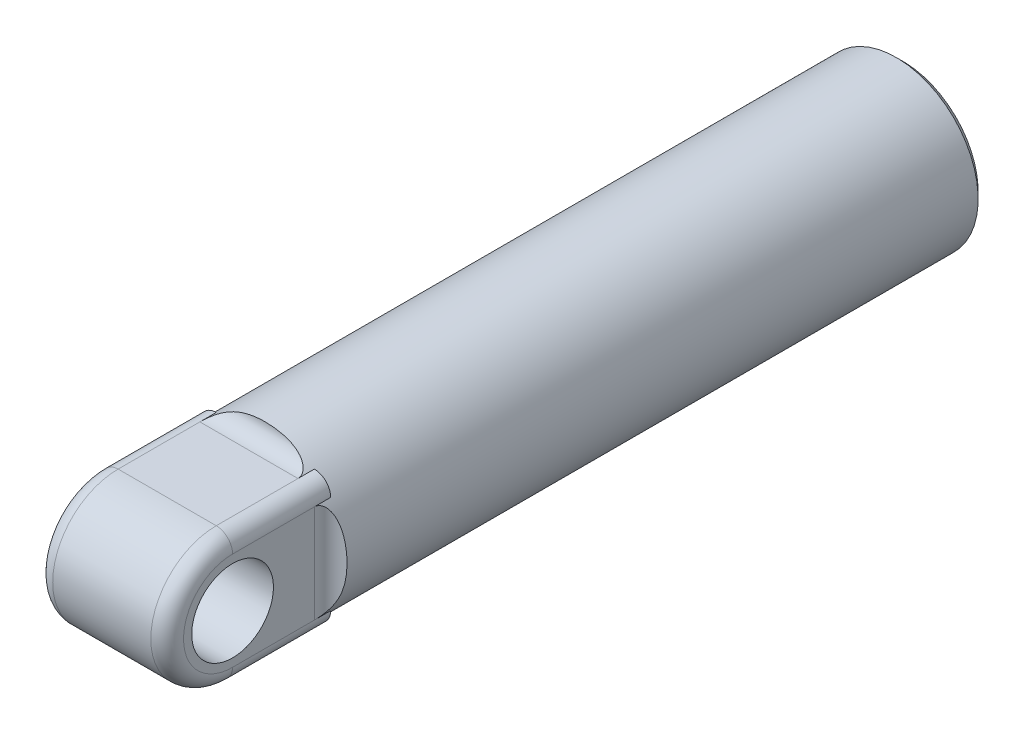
ISO-10303-21;
HEADER;
FILE_DESCRIPTION(('STEP AP214'),'2;1');
FILE_NAME('part.step','',(''),(''),'','','');
FILE_SCHEMA(('AUTOMOTIVE_DESIGN { 1 0 10303 214 1 1 1 1 }'));
ENDSEC;
DATA;
#1=APPLICATION_CONTEXT('core data for automotive mechanical design processes');
#2=APPLICATION_PROTOCOL_DEFINITION('international standard','automotive_design',2000,#1);
#3=PRODUCT_CONTEXT('',#1,'mechanical');
#4=PRODUCT('Part','Part','',(#3));
#5=PRODUCT_RELATED_PRODUCT_CATEGORY('part','',(#4));
#6=PRODUCT_DEFINITION_FORMATION('','',#4);
#7=PRODUCT_DEFINITION_CONTEXT('part definition',#1,'design');
#8=PRODUCT_DEFINITION('design','',#6,#7);
#9=PRODUCT_DEFINITION_SHAPE('','',#8);
#10=(LENGTH_UNIT() NAMED_UNIT(*) SI_UNIT(.MILLI.,.METRE.));
#11=(NAMED_UNIT(*) PLANE_ANGLE_UNIT() SI_UNIT($,.RADIAN.));
#12=(NAMED_UNIT(*) SI_UNIT($,.STERADIAN.) SOLID_ANGLE_UNIT());
#13=UNCERTAINTY_MEASURE_WITH_UNIT(LENGTH_MEASURE(1.E-05),#10,'distance_accuracy_value','');
#14=(GEOMETRIC_REPRESENTATION_CONTEXT(3) GLOBAL_UNCERTAINTY_ASSIGNED_CONTEXT((#13)) GLOBAL_UNIT_ASSIGNED_CONTEXT((#10,
#11,#12)) REPRESENTATION_CONTEXT('',''));
#15=CARTESIAN_POINT('',(0.,0.,0.));
#16=DIRECTION('',(0.,0.,1.));
#17=DIRECTION('',(1.,0.,0.));
#18=AXIS2_PLACEMENT_3D('',#15,#16,#17);
#19=CARTESIAN_POINT('',(40.,40.,-60.));
#20=DIRECTION('',(0.,0.,1.));
#21=DIRECTION('',(1.,0.,0.));
#22=AXIS2_PLACEMENT_3D('',#19,#20,#21);
#23=PLANE('',#22);
#24=CARTESIAN_POINT('',(0.,0.,-60.));
#25=DIRECTION('',(0.,0.,-1.));
#26=DIRECTION('',(-1.,0.,0.));
#27=AXIS2_PLACEMENT_3D('',#24,#25,#26);
#28=CIRCLE('',#27,50.);
#29=CARTESIAN_POINT('',(-40.,30.,-60.));
#30=VERTEX_POINT('',#29);
#31=CARTESIAN_POINT('',(-30.,40.,-60.));
#32=VERTEX_POINT('',#31);
#33=EDGE_CURVE('E147',#30,#32,#28,.T.);
#34=ORIENTED_EDGE('',*,*,#33,.F.);
#35=CARTESIAN_POINT('',(-30.,30.,-60.));
#36=DIRECTION('',(0.,0.,1.));
#37=DIRECTION('',(1.,0.,0.));
#38=AXIS2_PLACEMENT_3D('',#35,#36,#37);
#39=CIRCLE('',#38,10.);
#40=EDGE_CURVE('E295',#30,#32,#39,.F.);
#41=ORIENTED_EDGE('',*,*,#40,.T.);
#42=EDGE_LOOP('',(#34,#41));
#43=FACE_BOUND('',#42,.T.);
#44=ADVANCED_FACE('F32',(#43),#23,.F.);
#45=CARTESIAN_POINT('',(30.,40.,-60.));
#46=VERTEX_POINT('',#45);
#47=CARTESIAN_POINT('',(40.,30.,-60.));
#48=VERTEX_POINT('',#47);
#49=EDGE_CURVE('E139',#46,#48,#28,.T.);
#50=ORIENTED_EDGE('',*,*,#49,.F.);
#51=CARTESIAN_POINT('',(30.,30.,-60.));
#52=DIRECTION('',(0.,0.,1.));
#53=DIRECTION('',(1.,0.,0.));
#54=AXIS2_PLACEMENT_3D('',#51,#52,#53);
#55=CIRCLE('',#54,10.);
#56=EDGE_CURVE('E302',#46,#48,#55,.F.);
#57=ORIENTED_EDGE('',*,*,#56,.T.);
#58=EDGE_LOOP('',(#50,#57));
#59=FACE_BOUND('',#58,.T.);
#60=ADVANCED_FACE('F231',(#59),#23,.F.);
#61=CARTESIAN_POINT('',(40.,-30.,-60.));
#62=VERTEX_POINT('',#61);
#63=CARTESIAN_POINT('',(30.,-40.,-60.));
#64=VERTEX_POINT('',#63);
#65=EDGE_CURVE('E145',#62,#64,#28,.T.);
#66=ORIENTED_EDGE('',*,*,#65,.F.);
#67=CARTESIAN_POINT('',(30.,-30.,-60.));
#68=DIRECTION('',(0.,0.,1.));
#69=DIRECTION('',(1.,0.,0.));
#70=AXIS2_PLACEMENT_3D('',#67,#68,#69);
#71=CIRCLE('',#70,10.);
#72=EDGE_CURVE('E133',#62,#64,#71,.F.);
#73=ORIENTED_EDGE('',*,*,#72,.T.);
#74=EDGE_LOOP('',(#66,#73));
#75=FACE_BOUND('',#74,.T.);
#76=ADVANCED_FACE('F238',(#75),#23,.F.);
#77=CARTESIAN_POINT('',(40.,0.,0.));
#78=DIRECTION('',(1.,0.,0.));
#79=DIRECTION('',(0.,0.,-1.));
#80=AXIS2_PLACEMENT_3D('',#77,#78,#79);
#81=PLANE('',#80);
#82=DIRECTION('',(0.,0.,-1.));
#83=VECTOR('',#82,1.);
#84=CARTESIAN_POINT('',(40.,-30.,-60.));
#85=LINE('',#84,#83);
#86=CARTESIAN_POINT('',(40.,-30.,0.));
#87=VERTEX_POINT('',#86);
#88=CARTESIAN_POINT('',(40.,-30.,-50.));
#89=VERTEX_POINT('',#88);
#90=EDGE_CURVE('E102',#87,#89,#85,.T.);
#91=ORIENTED_EDGE('',*,*,#90,.T.);
#92=DIRECTION('',(0.,1.,0.));
#93=VECTOR('',#92,1.);
#94=CARTESIAN_POINT('',(40.,0.,-50.));
#95=LINE('',#94,#93);
#96=CARTESIAN_POINT('',(40.,30.,-50.));
#97=VERTEX_POINT('',#96);
#98=EDGE_CURVE('E107',#89,#97,#95,.T.);
#99=ORIENTED_EDGE('',*,*,#98,.T.);
#100=DIRECTION('',(0.,0.,1.));
#101=VECTOR('',#100,1.);
#102=CARTESIAN_POINT('',(40.,30.,0.));
#103=LINE('',#102,#101);
#104=CARTESIAN_POINT('',(40.,30.,0.));
#105=VERTEX_POINT('',#104);
#106=EDGE_CURVE('E116',#97,#105,#103,.T.);
#107=ORIENTED_EDGE('',*,*,#106,.T.);
#108=CARTESIAN_POINT('',(40.,0.,0.));
#109=DIRECTION('',(1.,0.,0.));
#110=DIRECTION('',(0.,0.,-1.));
#111=AXIS2_PLACEMENT_3D('',#108,#109,#110);
#112=CIRCLE('',#111,30.);
#113=EDGE_CURVE('E111',#105,#87,#112,.T.);
#114=ORIENTED_EDGE('',*,*,#113,.T.);
#115=EDGE_LOOP('',(#91,#99,#107,#114));
#116=FACE_BOUND('',#115,.T.);
#117=CARTESIAN_POINT('',(40.,0.,0.));
#118=DIRECTION('',(1.,0.,0.));
#119=DIRECTION('',(0.,0.,-1.));
#120=AXIS2_PLACEMENT_3D('',#117,#118,#119);
#121=CIRCLE('',#120,25.);
#122=CARTESIAN_POINT('',(40.,0.,-25.));
#123=VERTEX_POINT('',#122);
#124=EDGE_CURVE('E276',#123,#123,#121,.T.);
#125=ORIENTED_EDGE('',*,*,#124,.F.);
#126=EDGE_LOOP('',(#125));
#127=FACE_BOUND('',#126,.T.);
#128=ADVANCED_FACE('F103',(#116,#127),#81,.T.);
#129=CARTESIAN_POINT('',(-40.,0.,0.));
#130=DIRECTION('',(1.,0.,0.));
#131=DIRECTION('',(0.,0.,-1.));
#132=AXIS2_PLACEMENT_3D('',#129,#130,#131);
#133=PLANE('',#132);
#134=DIRECTION('',(0.,0.,1.));
#135=VECTOR('',#134,1.);
#136=CARTESIAN_POINT('',(-40.,30.,0.));
#137=LINE('',#136,#135);
#138=CARTESIAN_POINT('',(-40.,30.,0.));
#139=VERTEX_POINT('',#138);
#140=CARTESIAN_POINT('',(-40.,30.,-50.));
#141=VERTEX_POINT('',#140);
#142=EDGE_CURVE('E56',#139,#141,#137,.F.);
#143=ORIENTED_EDGE('',*,*,#142,.T.);
#144=DIRECTION('',(0.,1.,0.));
#145=VECTOR('',#144,1.);
#146=CARTESIAN_POINT('',(-40.,-30.,-50.));
#147=LINE('',#146,#145);
#148=CARTESIAN_POINT('',(-40.,-30.,-50.));
#149=VERTEX_POINT('',#148);
#150=EDGE_CURVE('E142',#141,#149,#147,.F.);
#151=ORIENTED_EDGE('',*,*,#150,.T.);
#152=DIRECTION('',(0.,0.,-1.));
#153=VECTOR('',#152,1.);
#154=CARTESIAN_POINT('',(-40.,-30.,0.));
#155=LINE('',#154,#153);
#156=CARTESIAN_POINT('',(-40.,-30.,0.));
#157=VERTEX_POINT('',#156);
#158=EDGE_CURVE('E313',#149,#157,#155,.F.);
#159=ORIENTED_EDGE('',*,*,#158,.T.);
#160=CARTESIAN_POINT('',(-40.,0.,0.));
#161=DIRECTION('',(1.,0.,0.));
#162=DIRECTION('',(0.,0.,-1.));
#163=AXIS2_PLACEMENT_3D('',#160,#161,#162);
#164=CIRCLE('',#163,30.);
#165=EDGE_CURVE('E311',#157,#139,#164,.F.);
#166=ORIENTED_EDGE('',*,*,#165,.T.);
#167=EDGE_LOOP('',(#143,#151,#159,#166));
#168=FACE_BOUND('',#167,.T.);
#169=CARTESIAN_POINT('',(-40.,0.,0.));
#170=DIRECTION('',(1.,0.,0.));
#171=DIRECTION('',(0.,0.,-1.));
#172=AXIS2_PLACEMENT_3D('',#169,#170,#171);
#173=CIRCLE('',#172,25.);
#174=CARTESIAN_POINT('',(-40.,0.,-25.));
#175=VERTEX_POINT('',#174);
#176=EDGE_CURVE('E280',#175,#175,#173,.T.);
#177=ORIENTED_EDGE('',*,*,#176,.T.);
#178=EDGE_LOOP('',(#177));
#179=FACE_BOUND('',#178,.T.);
#180=ADVANCED_FACE('F260',(#168,#179),#133,.F.);
#181=CARTESIAN_POINT('',(40.,0.,0.));
#182=DIRECTION('',(-1.,0.,0.));
#183=DIRECTION('',(0.,0.,1.));
#184=AXIS2_PLACEMENT_3D('',#181,#182,#183);
#185=CYLINDRICAL_SURFACE('',#184,40.);
#186=DIRECTION('',(-1.,0.,0.));
#187=VECTOR('',#186,1.);
#188=CARTESIAN_POINT('',(40.,40.,0.));
#189=LINE('',#188,#187);
#190=CARTESIAN_POINT('',(30.,40.,0.));
#191=VERTEX_POINT('',#190);
#192=CARTESIAN_POINT('',(-30.,40.,0.));
#193=VERTEX_POINT('',#192);
#194=EDGE_CURVE('E279',#191,#193,#189,.T.);
#195=ORIENTED_EDGE('',*,*,#194,.T.);
#196=CARTESIAN_POINT('',(-30.,0.,0.));
#197=DIRECTION('',(1.,0.,0.));
#198=DIRECTION('',(0.,0.,-1.));
#199=AXIS2_PLACEMENT_3D('',#196,#197,#198);
#200=CIRCLE('',#199,40.);
#201=CARTESIAN_POINT('',(-30.,-40.,0.));
#202=VERTEX_POINT('',#201);
#203=EDGE_CURVE('E269',#193,#202,#200,.T.);
#204=ORIENTED_EDGE('',*,*,#203,.T.);
#205=DIRECTION('',(-1.,0.,0.));
#206=VECTOR('',#205,1.);
#207=CARTESIAN_POINT('',(40.,-40.,0.));
#208=LINE('',#207,#206);
#209=CARTESIAN_POINT('',(30.,-40.,0.));
#210=VERTEX_POINT('',#209);
#211=EDGE_CURVE('E286',#210,#202,#208,.T.);
#212=ORIENTED_EDGE('',*,*,#211,.F.);
#213=CARTESIAN_POINT('',(30.,0.,0.));
#214=DIRECTION('',(1.,0.,0.));
#215=DIRECTION('',(0.,0.,-1.));
#216=AXIS2_PLACEMENT_3D('',#213,#214,#215);
#217=CIRCLE('',#216,40.);
#218=EDGE_CURVE('E316',#210,#191,#217,.F.);
#219=ORIENTED_EDGE('',*,*,#218,.T.);
#220=EDGE_LOOP('',(#195,#204,#212,#219));
#221=FACE_BOUND('',#220,.T.);
#222=ADVANCED_FACE('F252',(#221),#185,.T.);
#223=CARTESIAN_POINT('',(40.,-40.,-60.));
#224=DIRECTION('',(0.,1.,0.));
#225=DIRECTION('',(0.,0.,1.));
#226=AXIS2_PLACEMENT_3D('',#223,#224,#225);
#227=PLANE('',#226);
#228=DIRECTION('',(0.,0.,-1.));
#229=VECTOR('',#228,1.);
#230=CARTESIAN_POINT('',(-30.,-40.,-60.));
#231=LINE('',#230,#229);
#232=CARTESIAN_POINT('',(-30.,-40.,-50.));
#233=VERTEX_POINT('',#232);
#234=EDGE_CURVE('E305',#202,#233,#231,.T.);
#235=ORIENTED_EDGE('',*,*,#234,.T.);
#236=DIRECTION('',(-1.,0.,0.));
#237=VECTOR('',#236,1.);
#238=CARTESIAN_POINT('',(30.,-40.,-50.));
#239=LINE('',#238,#237);
#240=CARTESIAN_POINT('',(30.,-40.,-50.));
#241=VERTEX_POINT('',#240);
#242=EDGE_CURVE('E138',#233,#241,#239,.F.);
#243=ORIENTED_EDGE('',*,*,#242,.T.);
#244=DIRECTION('',(0.,0.,-1.));
#245=VECTOR('',#244,1.);
#246=CARTESIAN_POINT('',(30.,-40.,0.));
#247=LINE('',#246,#245);
#248=EDGE_CURVE('E307',#241,#210,#247,.F.);
#249=ORIENTED_EDGE('',*,*,#248,.T.);
#250=ORIENTED_EDGE('',*,*,#211,.T.);
#251=EDGE_LOOP('',(#235,#243,#249,#250));
#252=FACE_BOUND('',#251,.T.);
#253=ADVANCED_FACE('F245',(#252),#227,.F.);
#254=CARTESIAN_POINT('',(-30.,-40.,-60.));
#255=VERTEX_POINT('',#254);
#256=CARTESIAN_POINT('',(-40.,-30.,-60.));
#257=VERTEX_POINT('',#256);
#258=EDGE_CURVE('E267',#255,#257,#28,.T.);
#259=ORIENTED_EDGE('',*,*,#258,.F.);
#260=CARTESIAN_POINT('',(-30.,-30.,-60.));
#261=DIRECTION('',(0.,0.,1.));
#262=DIRECTION('',(1.,0.,0.));
#263=AXIS2_PLACEMENT_3D('',#260,#261,#262);
#264=CIRCLE('',#263,10.);
#265=EDGE_CURVE('E298',#255,#257,#264,.F.);
#266=ORIENTED_EDGE('',*,*,#265,.T.);
#267=EDGE_LOOP('',(#259,#266));
#268=FACE_BOUND('',#267,.T.);
#269=ADVANCED_FACE('F234',(#268),#23,.F.);
#270=CARTESIAN_POINT('',(40.,40.,0.));
#271=DIRECTION('',(0.,-1.,0.));
#272=DIRECTION('',(0.,0.,-1.));
#273=AXIS2_PLACEMENT_3D('',#270,#271,#272);
#274=PLANE('',#273);
#275=DIRECTION('',(0.,0.,1.));
#276=VECTOR('',#275,1.);
#277=CARTESIAN_POINT('',(30.,40.,-60.));
#278=LINE('',#277,#276);
#279=CARTESIAN_POINT('',(30.,40.,-50.));
#280=VERTEX_POINT('',#279);
#281=EDGE_CURVE('E47',#191,#280,#278,.F.);
#282=ORIENTED_EDGE('',*,*,#281,.T.);
#283=DIRECTION('',(-1.,0.,0.));
#284=VECTOR('',#283,1.);
#285=CARTESIAN_POINT('',(-30.,40.,-50.));
#286=LINE('',#285,#284);
#287=CARTESIAN_POINT('',(-30.,40.,-50.));
#288=VERTEX_POINT('',#287);
#289=EDGE_CURVE('E153',#280,#288,#286,.T.);
#290=ORIENTED_EDGE('',*,*,#289,.T.);
#291=DIRECTION('',(0.,0.,1.));
#292=VECTOR('',#291,1.);
#293=CARTESIAN_POINT('',(-30.,40.,0.));
#294=LINE('',#293,#292);
#295=EDGE_CURVE('E291',#288,#193,#294,.T.);
#296=ORIENTED_EDGE('',*,*,#295,.T.);
#297=ORIENTED_EDGE('',*,*,#194,.F.);
#298=EDGE_LOOP('',(#282,#290,#296,#297));
#299=FACE_BOUND('',#298,.T.);
#300=ADVANCED_FACE('F244',(#299),#274,.F.);
#301=CARTESIAN_POINT('',(40.,0.,0.));
#302=DIRECTION('',(-1.,0.,0.));
#303=DIRECTION('',(0.,0.,1.));
#304=AXIS2_PLACEMENT_3D('',#301,#302,#303);
#305=CYLINDRICAL_SURFACE('',#304,25.);
#306=ORIENTED_EDGE('',*,*,#124,.T.);
#307=EDGE_LOOP('',(#306));
#308=FACE_BOUND('',#307,.T.);
#309=ORIENTED_EDGE('',*,*,#176,.F.);
#310=EDGE_LOOP('',(#309));
#311=FACE_BOUND('',#310,.T.);
#312=ADVANCED_FACE('F251',(#308,#311),#305,.F.);
#313=CARTESIAN_POINT('',(30.,-30.,0.));
#314=DIRECTION('',(0.,0.,1.));
#315=DIRECTION('',(1.,0.,0.));
#316=AXIS2_PLACEMENT_3D('',#313,#314,#315);
#317=CYLINDRICAL_SURFACE('',#316,10.);
#318=ORIENTED_EDGE('',*,*,#72,.F.);
#319=DIRECTION('',(0.,0.,1.));
#320=VECTOR('',#319,1.);
#321=CARTESIAN_POINT('',(40.,-30.,-60.));
#322=LINE('',#321,#320);
#323=EDGE_CURVE('E124',#62,#89,#322,.T.);
#324=ORIENTED_EDGE('',*,*,#323,.T.);
#325=ORIENTED_EDGE('',*,*,#90,.F.);
#326=CARTESIAN_POINT('',(30.,-30.,0.));
#327=DIRECTION('',(0.,0.,1.));
#328=DIRECTION('',(1.,0.,0.));
#329=AXIS2_PLACEMENT_3D('',#326,#327,#328);
#330=CIRCLE('',#329,10.);
#331=EDGE_CURVE('E283',#210,#87,#330,.T.);
#332=ORIENTED_EDGE('',*,*,#331,.F.);
#333=ORIENTED_EDGE('',*,*,#248,.F.);
#334=DIRECTION('',(0.,0.,1.));
#335=VECTOR('',#334,1.);
#336=CARTESIAN_POINT('',(30.,-40.,-60.));
#337=LINE('',#336,#335);
#338=EDGE_CURVE('E371',#64,#241,#337,.T.);
#339=ORIENTED_EDGE('',*,*,#338,.F.);
#340=EDGE_LOOP('',(#318,#324,#325,#332,#333,#339));
#341=FACE_BOUND('',#340,.T.);
#342=ADVANCED_FACE('F130',(#341),#317,.T.);
#343=CARTESIAN_POINT('',(30.,0.,0.));
#344=DIRECTION('',(1.,0.,0.));
#345=DIRECTION('',(0.,0.,-1.));
#346=AXIS2_PLACEMENT_3D('',#343,#344,#345);
#347=TOROIDAL_SURFACE('',#346,30.,10.);
#348=ORIENTED_EDGE('',*,*,#331,.T.);
#349=ORIENTED_EDGE('',*,*,#113,.F.);
#350=CARTESIAN_POINT('',(30.,30.,0.));
#351=DIRECTION('',(0.,0.,-1.));
#352=DIRECTION('',(-1.,0.,0.));
#353=AXIS2_PLACEMENT_3D('',#350,#351,#352);
#354=CIRCLE('',#353,10.);
#355=EDGE_CURVE('E321',#191,#105,#354,.T.);
#356=ORIENTED_EDGE('',*,*,#355,.F.);
#357=ORIENTED_EDGE('',*,*,#218,.F.);
#358=EDGE_LOOP('',(#348,#349,#356,#357));
#359=FACE_BOUND('',#358,.T.);
#360=ADVANCED_FACE('F378',(#359),#347,.T.);
#361=CARTESIAN_POINT('',(30.,30.,0.));
#362=DIRECTION('',(0.,0.,-1.));
#363=DIRECTION('',(-1.,0.,0.));
#364=AXIS2_PLACEMENT_3D('',#361,#362,#363);
#365=CYLINDRICAL_SURFACE('',#364,10.);
#366=ORIENTED_EDGE('',*,*,#56,.F.);
#367=DIRECTION('',(0.,0.,1.));
#368=VECTOR('',#367,1.);
#369=CARTESIAN_POINT('',(30.,40.,-60.));
#370=LINE('',#369,#368);
#371=EDGE_CURVE('E384',#46,#280,#370,.T.);
#372=ORIENTED_EDGE('',*,*,#371,.T.);
#373=ORIENTED_EDGE('',*,*,#281,.F.);
#374=ORIENTED_EDGE('',*,*,#355,.T.);
#375=ORIENTED_EDGE('',*,*,#106,.F.);
#376=DIRECTION('',(0.,0.,-1.));
#377=VECTOR('',#376,1.);
#378=CARTESIAN_POINT('',(40.,30.,-60.));
#379=LINE('',#378,#377);
#380=EDGE_CURVE('E135',#48,#97,#379,.F.);
#381=ORIENTED_EDGE('',*,*,#380,.F.);
#382=EDGE_LOOP('',(#366,#372,#373,#374,#375,#381));
#383=FACE_BOUND('',#382,.T.);
#384=ADVANCED_FACE('F382',(#383),#365,.T.);
#385=CARTESIAN_POINT('',(-30.,30.,0.));
#386=DIRECTION('',(0.,0.,1.));
#387=DIRECTION('',(1.,0.,0.));
#388=AXIS2_PLACEMENT_3D('',#385,#386,#387);
#389=CYLINDRICAL_SURFACE('',#388,10.);
#390=ORIENTED_EDGE('',*,*,#40,.F.);
#391=DIRECTION('',(0.,0.,1.));
#392=VECTOR('',#391,1.);
#393=CARTESIAN_POINT('',(-40.,30.,-60.));
#394=LINE('',#393,#392);
#395=EDGE_CURVE('E391',#30,#141,#394,.T.);
#396=ORIENTED_EDGE('',*,*,#395,.T.);
#397=ORIENTED_EDGE('',*,*,#142,.F.);
#398=CARTESIAN_POINT('',(-30.,30.,0.));
#399=DIRECTION('',(0.,0.,1.));
#400=DIRECTION('',(1.,0.,0.));
#401=AXIS2_PLACEMENT_3D('',#398,#399,#400);
#402=CIRCLE('',#401,10.);
#403=EDGE_CURVE('E149',#193,#139,#402,.T.);
#404=ORIENTED_EDGE('',*,*,#403,.F.);
#405=ORIENTED_EDGE('',*,*,#295,.F.);
#406=DIRECTION('',(0.,0.,1.));
#407=VECTOR('',#406,1.);
#408=CARTESIAN_POINT('',(-30.,40.,-60.));
#409=LINE('',#408,#407);
#410=EDGE_CURVE('E387',#32,#288,#409,.T.);
#411=ORIENTED_EDGE('',*,*,#410,.F.);
#412=EDGE_LOOP('',(#390,#396,#397,#404,#405,#411));
#413=FACE_BOUND('',#412,.T.);
#414=ADVANCED_FACE('F175',(#413),#389,.T.);
#415=CARTESIAN_POINT('',(-30.,0.,0.));
#416=DIRECTION('',(1.,0.,0.));
#417=DIRECTION('',(0.,0.,-1.));
#418=AXIS2_PLACEMENT_3D('',#415,#416,#417);
#419=TOROIDAL_SURFACE('',#418,30.,10.);
#420=ORIENTED_EDGE('',*,*,#403,.T.);
#421=ORIENTED_EDGE('',*,*,#165,.F.);
#422=CARTESIAN_POINT('',(-30.,-30.,0.));
#423=DIRECTION('',(0.,0.,-1.));
#424=DIRECTION('',(-1.,0.,0.));
#425=AXIS2_PLACEMENT_3D('',#422,#423,#424);
#426=CIRCLE('',#425,10.);
#427=EDGE_CURVE('E272',#202,#157,#426,.T.);
#428=ORIENTED_EDGE('',*,*,#427,.F.);
#429=ORIENTED_EDGE('',*,*,#203,.F.);
#430=EDGE_LOOP('',(#420,#421,#428,#429));
#431=FACE_BOUND('',#430,.T.);
#432=ADVANCED_FACE('F335',(#431),#419,.T.);
#433=CARTESIAN_POINT('',(-30.,-30.,-60.));
#434=DIRECTION('',(0.,0.,-1.));
#435=DIRECTION('',(-1.,0.,0.));
#436=AXIS2_PLACEMENT_3D('',#433,#434,#435);
#437=CYLINDRICAL_SURFACE('',#436,10.);
#438=ORIENTED_EDGE('',*,*,#427,.T.);
#439=ORIENTED_EDGE('',*,*,#158,.F.);
#440=DIRECTION('',(0.,0.,-1.));
#441=VECTOR('',#440,1.);
#442=CARTESIAN_POINT('',(-40.,-30.,-60.));
#443=LINE('',#442,#441);
#444=EDGE_CURVE('E393',#257,#149,#443,.F.);
#445=ORIENTED_EDGE('',*,*,#444,.F.);
#446=ORIENTED_EDGE('',*,*,#265,.F.);
#447=DIRECTION('',(0.,0.,1.));
#448=VECTOR('',#447,1.);
#449=CARTESIAN_POINT('',(-30.,-40.,-60.));
#450=LINE('',#449,#448);
#451=EDGE_CURVE('E134',#255,#233,#450,.T.);
#452=ORIENTED_EDGE('',*,*,#451,.T.);
#453=ORIENTED_EDGE('',*,*,#234,.F.);
#454=EDGE_LOOP('',(#438,#439,#445,#446,#452,#453));
#455=FACE_BOUND('',#454,.T.);
#456=ADVANCED_FACE('F367',(#455),#437,.T.);
#457=CARTESIAN_POINT('',(0.,0.,-450.));
#458=DIRECTION('',(0.,0.,1.));
#459=DIRECTION('',(1.,0.,0.));
#460=AXIS2_PLACEMENT_3D('',#457,#458,#459);
#461=CYLINDRICAL_SURFACE('',#460,50.);
#462=CARTESIAN_POINT('',(0.,0.,-446.));
#463=DIRECTION('',(0.,0.,-1.));
#464=DIRECTION('',(-1.,0.,0.));
#465=AXIS2_PLACEMENT_3D('',#462,#463,#464);
#466=CIRCLE('',#465,50.);
#467=CARTESIAN_POINT('',(-50.,0.,-446.));
#468=VERTEX_POINT('',#467);
#469=EDGE_CURVE('E11',#468,#468,#466,.F.);
#470=ORIENTED_EDGE('',*,*,#469,.T.);
#471=EDGE_LOOP('',(#470));
#472=FACE_BOUND('',#471,.T.);
#473=ORIENTED_EDGE('',*,*,#33,.T.);
#474=ORIENTED_EDGE('',*,*,#410,.T.);
#475=CARTESIAN_POINT('',(-30.,40.,-50.));
#476=CARTESIAN_POINT('',(-30.0000014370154,39.9999981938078,-50.0992636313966));
#477=CARTESIAN_POINT('',(-29.9980287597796,40.0014785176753,-50.1985104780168));
#478=CARTESIAN_POINT('',(-29.9901554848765,40.0073819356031,-50.3967538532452));
#479=CARTESIAN_POINT('',(-29.9842551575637,40.0118048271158,-50.4957503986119));
#480=CARTESIAN_POINT('',(-29.9607110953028,40.0294416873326,-50.7918293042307));
#481=CARTESIAN_POINT('',(-29.9372241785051,40.0470239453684,-50.9882337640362));
#482=CARTESIAN_POINT('',(-29.8754508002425,40.0931277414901,-51.3753288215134));
#483=CARTESIAN_POINT('',(-29.8373125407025,40.1215397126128,-51.5660566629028));
#484=CARTESIAN_POINT('',(-29.7469482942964,40.1885833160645,-51.9423254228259));
#485=CARTESIAN_POINT('',(-29.6947200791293,40.2272165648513,-52.1278655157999));
#486=CARTESIAN_POINT('',(-29.577297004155,40.3136301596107,-52.4918048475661));
#487=CARTESIAN_POINT('',(-29.5121497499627,40.3613768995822,-52.6702274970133));
#488=CARTESIAN_POINT('',(-29.3697788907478,40.4650945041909,-53.0197462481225));
#489=CARTESIAN_POINT('',(-29.2925495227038,40.5210692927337,-53.1908388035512));
#490=CARTESIAN_POINT('',(-29.043962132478,40.6999972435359,-53.6927013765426));
#491=CARTESIAN_POINT('',(-28.855880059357,40.8338233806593,-54.0115267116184));
#492=CARTESIAN_POINT('',(-28.503104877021,41.0804728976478,-54.5275777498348));
#493=CARTESIAN_POINT('',(-28.3471769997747,41.1883103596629,-54.7334515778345));
#494=CARTESIAN_POINT('',(-28.0196038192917,41.4118471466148,-55.1278607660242));
#495=CARTESIAN_POINT('',(-27.8479524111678,41.5275495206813,-55.3163893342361));
#496=CARTESIAN_POINT('',(-27.4911376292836,41.7646176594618,-55.6767140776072));
#497=CARTESIAN_POINT('',(-27.3059589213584,41.8859897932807,-55.8484907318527));
#498=CARTESIAN_POINT('',(-26.9241741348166,42.1324169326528,-56.176012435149));
#499=CARTESIAN_POINT('',(-26.7275641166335,42.2574732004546,-56.3317519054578));
#500=CARTESIAN_POINT('',(-26.2052411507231,42.5843660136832,-56.7159884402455));
#501=CARTESIAN_POINT('',(-25.8720266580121,42.7878131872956,-56.9329525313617));
#502=CARTESIAN_POINT('',(-25.186138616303,43.1951139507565,-57.33314954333));
#503=CARTESIAN_POINT('',(-24.8334531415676,43.3989677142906,-57.516361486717));
#504=CARTESIAN_POINT('',(-24.1120550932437,43.8038832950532,-57.8535109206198));
#505=CARTESIAN_POINT('',(-23.7433172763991,44.0049400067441,-58.0074000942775));
#506=CARTESIAN_POINT('',(-22.9933576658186,44.4014127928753,-58.2894506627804));
#507=CARTESIAN_POINT('',(-22.6121374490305,44.5968295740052,-58.4176152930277));
#508=CARTESIAN_POINT('',(-21.8668512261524,44.9666702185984,-58.6434433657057));
#509=CARTESIAN_POINT('',(-21.5034908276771,45.1415991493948,-58.7426269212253));
#510=CARTESIAN_POINT('',(-20.7691833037,45.484120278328,-58.9243723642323));
#511=CARTESIAN_POINT('',(-20.3982348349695,45.6517111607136,-59.0069312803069));
#512=CARTESIAN_POINT('',(-19.6496468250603,45.9788905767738,-59.1576819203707));
#513=CARTESIAN_POINT('',(-19.2720026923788,46.1384733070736,-59.2258633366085));
#514=CARTESIAN_POINT('',(-18.5111819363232,46.4489500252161,-59.3497579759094));
#515=CARTESIAN_POINT('',(-18.128005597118,46.5998444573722,-59.405471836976));
#516=CARTESIAN_POINT('',(-17.3552243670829,46.893152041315,-59.5064002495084));
#517=CARTESIAN_POINT('',(-16.9655994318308,47.0355275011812,-59.5515703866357));
#518=CARTESIAN_POINT('',(-16.18207816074,47.3108103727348,-59.6326967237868));
#519=CARTESIAN_POINT('',(-15.7881817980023,47.4437177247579,-59.6686528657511));
#520=CARTESIAN_POINT('',(-14.9967443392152,47.6997966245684,-59.7327529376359));
#521=CARTESIAN_POINT('',(-14.5992043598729,47.8229710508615,-59.7608991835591));
#522=CARTESIAN_POINT('',(-13.8007905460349,48.059458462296,-59.8106519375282));
#523=CARTESIAN_POINT('',(-13.3999165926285,48.1727710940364,-59.8322582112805));
#524=CARTESIAN_POINT('',(-12.4658345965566,48.4242312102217,-59.8761377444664));
#525=CARTESIAN_POINT('',(-11.931523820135,48.5586480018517,-59.8963913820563));
#526=CARTESIAN_POINT('',(-10.8585321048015,48.8097932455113,-59.9297251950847));
#527=CARTESIAN_POINT('',(-10.3198509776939,48.9265209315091,-59.9428050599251));
#528=CARTESIAN_POINT('',(-9.23866285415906,49.1421516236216,-59.963725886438));
#529=CARTESIAN_POINT('',(-8.69615473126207,49.2410491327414,-59.9715652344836));
#530=CARTESIAN_POINT('',(-7.60812665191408,49.4208503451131,-59.9836217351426));
#531=CARTESIAN_POINT('',(-7.06260668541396,49.5017539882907,-59.987838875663));
#532=CARTESIAN_POINT('',(-5.97585787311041,49.6445948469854,-59.9939348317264));
#533=CARTESIAN_POINT('',(-5.43465803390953,49.7067517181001,-59.9958415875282));
#534=CARTESIAN_POINT('',(-4.35051549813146,49.8133486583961,-59.998399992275));
#535=CARTESIAN_POINT('',(-3.80757279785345,49.8577886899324,-59.9990516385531));
#536=CARTESIAN_POINT('',(-2.72080628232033,49.9288851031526,-59.9998106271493));
#537=CARTESIAN_POINT('',(-2.17698309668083,49.9555510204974,-59.9999182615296));
#538=CARTESIAN_POINT('',(-1.36083521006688,49.9822191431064,-59.9999875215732));
#539=CARTESIAN_POINT('',(-1.08871335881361,49.9888867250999,-59.999995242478));
#540=CARTESIAN_POINT('',(-0.544395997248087,49.9977771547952,-60.0000003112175));
#541=CARTESIAN_POINT('',(-0.272200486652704,49.9999999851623,-59.9999976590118));
#542=CARTESIAN_POINT('',(0.,50.,-60.));
#543=B_SPLINE_CURVE_WITH_KNOTS('',3,(#475,#476,#477,#478,#479,#480,#481,#482,#483,#484,#485,
#486,#487,#488,#489,#490,#491,#492,#493,#494,#495,#496,#497,#498,#499,#500,#501,#502,#503,#504,
#505,#506,#507,#508,#509,#510,#511,#512,#513,#514,#515,#516,#517,#518,#519,#520,#521,#522,#523,
#524,#525,#526,#527,#528,#529,#530,#531,#532,#533,#534,#535,#536,#537,#538,#539,#540,#541,#542),
.UNSPECIFIED.,.F.,.F.,(4,2,2,2,2,2,2,2,2,2,2,2,2,2,2,2,2,2,2,2,2,2,2,2,2,2,2,2,2,2,2,2,2,4),(0.,
0.297727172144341,0.595433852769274,1.19015181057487,1.77900604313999,2.36795345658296,
2.95476967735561,3.54186666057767,4.71775961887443,5.55636975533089,6.39530688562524,
7.23521022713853,8.07540475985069,9.41317797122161,10.7517798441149,12.0925686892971,
13.4331887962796,14.6785587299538,15.9241510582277,17.1706333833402,18.4170519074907,
19.6686297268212,20.9202154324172,22.1714295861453,23.4226885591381,25.076301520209,
26.7299860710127,28.3841795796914,30.0383786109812,31.6723665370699,33.3063579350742,
34.9394720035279,35.7560512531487,36.5726336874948),.UNSPECIFIED.);
#544=CARTESIAN_POINT('',(0.,50.,-60.));
#545=VERTEX_POINT('',#544);
#546=EDGE_CURVE('E73',#288,#545,#543,.T.);
#547=ORIENTED_EDGE('',*,*,#546,.T.);
#548=CARTESIAN_POINT('',(0.,50.,-60.));
#549=CARTESIAN_POINT('',(0.349400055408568,50.000000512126,-59.9999915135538));
#550=CARTESIAN_POINT('',(0.698799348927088,49.9963375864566,-59.9999997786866));
#551=CARTESIAN_POINT('',(1.39744186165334,49.9816888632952,-59.9999881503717));
#552=CARTESIAN_POINT('',(1.74668508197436,49.9707031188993,-59.9999682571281));
#553=CARTESIAN_POINT('',(2.44487855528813,49.9414122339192,-59.9998386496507));
#554=CARTESIAN_POINT('',(2.79382879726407,49.9231068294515,-59.9997289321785));
#555=CARTESIAN_POINT('',(3.49126537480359,49.8791856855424,-59.9992938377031));
#556=CARTESIAN_POINT('',(3.83975170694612,49.8535698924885,-59.9989684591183));
#557=CARTESIAN_POINT('',(4.8859044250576,49.7656354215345,-59.9974299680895));
#558=CARTESIAN_POINT('',(5.58267777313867,49.6922961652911,-59.9956534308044));
#559=CARTESIAN_POINT('',(6.97247413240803,49.5164139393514,-59.9886869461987));
#560=CARTESIAN_POINT('',(7.66549723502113,49.4138716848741,-59.9834970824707));
#561=CARTESIAN_POINT('',(9.04466119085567,49.1800967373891,-59.9670185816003));
#562=CARTESIAN_POINT('',(9.73081575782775,49.048943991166,-59.9557468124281));
#563=CARTESIAN_POINT('',(11.096808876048,48.7580601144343,-59.9236588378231));
#564=CARTESIAN_POINT('',(11.7766476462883,48.5983299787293,-59.9028429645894));
#565=CARTESIAN_POINT('',(13.1276408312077,48.2509158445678,-59.8474164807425));
#566=CARTESIAN_POINT('',(13.7988055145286,48.0632689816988,-59.812824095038));
#567=CARTESIAN_POINT('',(15.1314742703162,47.6604945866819,-59.7246732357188));
#568=CARTESIAN_POINT('',(15.7929808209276,47.4453742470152,-59.671119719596));
#569=CARTESIAN_POINT('',(16.8661441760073,47.0715287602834,-59.5627877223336));
#570=CARTESIAN_POINT('',(17.2813195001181,46.9206830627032,-59.5155124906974));
#571=CARTESIAN_POINT('',(18.1061593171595,46.6085976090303,-59.4088049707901));
#572=CARTESIAN_POINT('',(18.5158242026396,46.4473585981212,-59.3493735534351));
#573=CARTESIAN_POINT('',(19.3299844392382,46.1144843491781,-59.2160195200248));
#574=CARTESIAN_POINT('',(19.7344610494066,45.9428199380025,-59.1420548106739));
#575=CARTESIAN_POINT('',(20.5359286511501,45.5902107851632,-58.9772837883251));
#576=CARTESIAN_POINT('',(20.9329191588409,45.4092654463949,-58.8864763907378));
#577=CARTESIAN_POINT('',(21.8111290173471,44.9951419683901,-58.6613764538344));
#578=CARTESIAN_POINT('',(22.2899965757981,44.759753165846,-58.5218784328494));
#579=CARTESIAN_POINT('',(23.2309499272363,44.2786847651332,-58.2066647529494));
#580=CARTESIAN_POINT('',(23.693027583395,44.0330002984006,-58.0309318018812));
#581=CARTESIAN_POINT('',(24.3683517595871,43.6606154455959,-57.7354416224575));
#582=CARTESIAN_POINT('',(24.5899890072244,43.5361442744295,-57.6319131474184));
#583=CARTESIAN_POINT('',(25.0270187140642,43.286390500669,-57.4131661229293));
#584=CARTESIAN_POINT('',(25.2424106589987,43.1611078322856,-57.2979466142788));
#585=CARTESIAN_POINT('',(25.6657188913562,42.9107362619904,-57.0549789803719));
#586=CARTESIAN_POINT('',(25.8736437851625,42.7856473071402,-56.9272459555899));
#587=CARTESIAN_POINT('',(26.2811096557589,42.5365754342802,-56.658145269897));
#588=CARTESIAN_POINT('',(26.4806530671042,42.4125922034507,-56.5167816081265));
#589=CARTESIAN_POINT('',(26.8443707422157,42.183168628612,-56.2390039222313));
#590=CARTESIAN_POINT('',(27.0097392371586,42.0774389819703,-56.1043952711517));
#591=CARTESIAN_POINT('',(27.3321170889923,41.8687500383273,-55.8235195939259));
#592=CARTESIAN_POINT('',(27.4891273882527,41.76579042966,-55.6772538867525));
#593=CARTESIAN_POINT('',(27.7937123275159,41.563721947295,-55.3723996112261));
#594=CARTESIAN_POINT('',(27.9412794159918,41.4646161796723,-55.2138013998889));
#595=CARTESIAN_POINT('',(28.2254904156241,41.27167553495,-54.8839397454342));
#596=CARTESIAN_POINT('',(28.3621306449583,41.1778424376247,-54.7126720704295));
#597=CARTESIAN_POINT('',(28.6245778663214,40.9958459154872,-54.3549968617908));
#598=CARTESIAN_POINT('',(28.7502168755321,40.9077743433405,-54.1684184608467));
#599=CARTESIAN_POINT('',(28.9866873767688,40.7405562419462,-53.7824449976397));
#600=CARTESIAN_POINT('',(29.0975282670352,40.6614040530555,-53.5830581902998));
#601=CARTESIAN_POINT('',(29.3022230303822,40.5141405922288,-53.1726713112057));
#602=CARTESIAN_POINT('',(29.3961286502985,40.4459957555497,-52.9617092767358));
#603=CARTESIAN_POINT('',(29.5653870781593,40.3224365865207,-52.5289013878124));
#604=CARTESIAN_POINT('',(29.6407473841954,40.2670171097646,-52.3070599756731));
#605=CARTESIAN_POINT('',(29.7537163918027,40.1835773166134,-51.9148505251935));
#606=CARTESIAN_POINT('',(29.7960330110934,40.1521916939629,-51.7465377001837));
#607=CARTESIAN_POINT('',(29.8691197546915,40.0978522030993,-51.4061173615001));
#608=CARTESIAN_POINT('',(29.8998935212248,40.074895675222,-51.2340110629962));
#609=CARTESIAN_POINT('',(29.9496158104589,40.0377514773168,-50.8857053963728));
#610=CARTESIAN_POINT('',(29.9684657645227,40.0236369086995,-50.7094840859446));
#611=CARTESIAN_POINT('',(29.9936811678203,40.0047389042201,-50.3555171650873));
#612=CARTESIAN_POINT('',(30.000036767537,39.9999628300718,-50.1777704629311));
#613=CARTESIAN_POINT('',(30.,40.,-50.));
#614=B_SPLINE_CURVE_WITH_KNOTS('',3,(#548,#549,#550,#551,#552,#553,#554,#555,#556,#557,#558,
#559,#560,#561,#562,#563,#564,#565,#566,#567,#568,#569,#570,#571,#572,#573,#574,#575,#576,#577,
#578,#579,#580,#581,#582,#583,#584,#585,#586,#587,#588,#589,#590,#591,#592,#593,#594,#595,#596,
#597,#598,#599,#600,#601,#602,#603,#604,#605,#606,#607,#608,#609,#610,#611,#612,#613),
.UNSPECIFIED.,.F.,.F.,(4,2,2,2,2,2,2,2,2,2,2,2,2,2,2,2,2,2,2,2,2,2,2,2,2,2,2,2,2,2,2,2,4),(0.,
1.04817945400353,2.09635130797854,3.1445609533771,4.19277828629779,6.29397364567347,
8.39511754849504,10.4904637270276,12.585736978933,14.678247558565,16.7702114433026,
18.1026936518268,19.4350804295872,20.7713846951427,22.1077750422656,23.7610886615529,
25.4151931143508,26.2383447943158,27.061564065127,27.8838018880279,28.7057992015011,
29.4194045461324,30.1329292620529,30.8470176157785,31.5613455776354,32.2851607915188,
33.0085141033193,33.7296182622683,34.4504303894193,34.9789606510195,35.5073239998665,
36.0399998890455,36.5730955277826),.UNSPECIFIED.);
#615=EDGE_CURVE('E213',#545,#280,#614,.T.);
#616=ORIENTED_EDGE('',*,*,#615,.T.);
#617=ORIENTED_EDGE('',*,*,#371,.F.);
#618=ORIENTED_EDGE('',*,*,#49,.T.);
#619=ORIENTED_EDGE('',*,*,#380,.T.);
#620=CARTESIAN_POINT('',(40.,30.,-50.));
#621=CARTESIAN_POINT('',(39.9999981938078,30.0000014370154,-50.0992636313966));
#622=CARTESIAN_POINT('',(40.0014785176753,29.9980287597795,-50.1985104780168));
#623=CARTESIAN_POINT('',(40.0073819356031,29.9901554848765,-50.3967538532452));
#624=CARTESIAN_POINT('',(40.0118048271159,29.9842551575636,-50.4957503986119));
#625=CARTESIAN_POINT('',(40.0294416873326,29.9607110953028,-50.7918293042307));
#626=CARTESIAN_POINT('',(40.0470239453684,29.9372241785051,-50.9882337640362));
#627=CARTESIAN_POINT('',(40.0931277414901,29.8754508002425,-51.3753288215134));
#628=CARTESIAN_POINT('',(40.1215397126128,29.8373125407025,-51.5660566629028));
#629=CARTESIAN_POINT('',(40.1885833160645,29.7469482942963,-51.9423254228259));
#630=CARTESIAN_POINT('',(40.2272165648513,29.6947200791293,-52.1278655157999));
#631=CARTESIAN_POINT('',(40.3136301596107,29.577297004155,-52.4918048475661));
#632=CARTESIAN_POINT('',(40.3613768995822,29.5121497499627,-52.6702274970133));
#633=CARTESIAN_POINT('',(40.4650945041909,29.3697788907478,-53.0197462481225));
#634=CARTESIAN_POINT('',(40.5210692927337,29.2925495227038,-53.1908388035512));
#635=CARTESIAN_POINT('',(40.6999972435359,29.0439621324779,-53.6927013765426));
#636=CARTESIAN_POINT('',(40.8338233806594,28.855880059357,-54.0115267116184));
#637=CARTESIAN_POINT('',(41.0804728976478,28.503104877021,-54.5275777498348));
#638=CARTESIAN_POINT('',(41.1883103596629,28.3471769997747,-54.7334515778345));
#639=CARTESIAN_POINT('',(41.4118471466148,28.0196038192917,-55.1278607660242));
#640=CARTESIAN_POINT('',(41.5275495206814,27.8479524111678,-55.3163893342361));
#641=CARTESIAN_POINT('',(41.7646176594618,27.4911376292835,-55.6767140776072));
#642=CARTESIAN_POINT('',(41.8859897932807,27.3059589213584,-55.8484907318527));
#643=CARTESIAN_POINT('',(42.1324169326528,26.9241741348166,-56.176012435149));
#644=CARTESIAN_POINT('',(42.2574732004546,26.7275641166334,-56.3317519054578));
#645=CARTESIAN_POINT('',(42.5843660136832,26.2052411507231,-56.7159884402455));
#646=CARTESIAN_POINT('',(42.7878131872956,25.872026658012,-56.9329525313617));
#647=CARTESIAN_POINT('',(43.1951139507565,25.186138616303,-57.33314954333));
#648=CARTESIAN_POINT('',(43.3989677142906,24.8334531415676,-57.516361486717));
#649=CARTESIAN_POINT('',(43.8038832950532,24.1120550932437,-57.8535109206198));
#650=CARTESIAN_POINT('',(44.0049400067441,23.7433172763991,-58.0074000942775));
#651=CARTESIAN_POINT('',(44.4014127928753,22.9933576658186,-58.2894506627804));
#652=CARTESIAN_POINT('',(44.5968295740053,22.6121374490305,-58.4176152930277));
#653=CARTESIAN_POINT('',(44.9666702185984,21.8668512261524,-58.6434433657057));
#654=CARTESIAN_POINT('',(45.1415991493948,21.5034908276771,-58.7426269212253));
#655=CARTESIAN_POINT('',(45.484120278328,20.7691833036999,-58.9243723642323));
#656=CARTESIAN_POINT('',(45.6517111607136,20.3982348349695,-59.0069312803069));
#657=CARTESIAN_POINT('',(45.9788905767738,19.6496468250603,-59.1576819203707));
#658=CARTESIAN_POINT('',(46.1384733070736,19.2720026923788,-59.2258633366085));
#659=CARTESIAN_POINT('',(46.4489500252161,18.5111819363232,-59.3497579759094));
#660=CARTESIAN_POINT('',(46.5998444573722,18.128005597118,-59.405471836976));
#661=CARTESIAN_POINT('',(46.893152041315,17.3552243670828,-59.5064002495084));
#662=CARTESIAN_POINT('',(47.0355275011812,16.9655994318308,-59.5515703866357));
#663=CARTESIAN_POINT('',(47.3108103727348,16.18207816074,-59.6326967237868));
#664=CARTESIAN_POINT('',(47.4437177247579,15.7881817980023,-59.6686528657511));
#665=CARTESIAN_POINT('',(47.6997966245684,14.9967443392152,-59.7327529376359));
#666=CARTESIAN_POINT('',(47.8229710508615,14.5992043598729,-59.7608991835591));
#667=CARTESIAN_POINT('',(48.059458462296,13.8007905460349,-59.8106519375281));
#668=CARTESIAN_POINT('',(48.1727710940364,13.3999165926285,-59.8322582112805));
#669=CARTESIAN_POINT('',(48.4242312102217,12.4658345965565,-59.8761377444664));
#670=CARTESIAN_POINT('',(48.5586480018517,11.931523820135,-59.8963913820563));
#671=CARTESIAN_POINT('',(48.8097932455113,10.8585321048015,-59.9297251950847));
#672=CARTESIAN_POINT('',(48.9265209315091,10.3198509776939,-59.9428050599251));
#673=CARTESIAN_POINT('',(49.1421516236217,9.23866285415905,-59.963725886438));
#674=CARTESIAN_POINT('',(49.2410491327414,8.69615473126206,-59.9715652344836));
#675=CARTESIAN_POINT('',(49.4208503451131,7.60812665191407,-59.9836217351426));
#676=CARTESIAN_POINT('',(49.5017539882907,7.06260668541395,-59.987838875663));
#677=CARTESIAN_POINT('',(49.6445948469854,5.9758578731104,-59.9939348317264));
#678=CARTESIAN_POINT('',(49.7067517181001,5.43465803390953,-59.9958415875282));
#679=CARTESIAN_POINT('',(49.8133486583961,4.35051549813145,-59.998399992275));
#680=CARTESIAN_POINT('',(49.8577886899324,3.80757279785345,-59.9990516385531));
#681=CARTESIAN_POINT('',(49.9288851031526,2.72080628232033,-59.9998106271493));
#682=CARTESIAN_POINT('',(49.9555510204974,2.17698309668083,-59.9999182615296));
#683=CARTESIAN_POINT('',(49.9822191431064,1.36083521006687,-59.9999875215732));
#684=CARTESIAN_POINT('',(49.9888867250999,1.0887133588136,-59.999995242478));
#685=CARTESIAN_POINT('',(49.9977771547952,0.544395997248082,-60.0000003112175));
#686=CARTESIAN_POINT('',(49.9999999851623,0.272200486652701,-59.9999976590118));
#687=CARTESIAN_POINT('',(50.,0.,-60.));
#688=B_SPLINE_CURVE_WITH_KNOTS('',3,(#620,#621,#622,#623,#624,#625,#626,#627,#628,#629,#630,
#631,#632,#633,#634,#635,#636,#637,#638,#639,#640,#641,#642,#643,#644,#645,#646,#647,#648,#649,
#650,#651,#652,#653,#654,#655,#656,#657,#658,#659,#660,#661,#662,#663,#664,#665,#666,#667,#668,
#669,#670,#671,#672,#673,#674,#675,#676,#677,#678,#679,#680,#681,#682,#683,#684,#685,#686,#687),
.UNSPECIFIED.,.F.,.F.,(4,2,2,2,2,2,2,2,2,2,2,2,2,2,2,2,2,2,2,2,2,2,2,2,2,2,2,2,2,2,2,2,2,4),(0.,
0.297727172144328,0.595433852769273,1.19015181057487,1.77900604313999,2.36795345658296,
2.95476967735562,3.54186666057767,4.71775961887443,5.5563697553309,6.39530688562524,
7.23521022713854,8.0754047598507,9.41317797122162,10.7517798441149,12.0925686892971,
13.4331887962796,14.6785587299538,15.9241510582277,17.1706333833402,18.4170519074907,
19.6686297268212,20.9202154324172,22.1714295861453,23.4226885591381,25.076301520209,
26.7299860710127,28.3841795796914,30.0383786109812,31.6723665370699,33.3063579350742,
34.9394720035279,35.7560512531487,36.5726336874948),.UNSPECIFIED.);
#689=CARTESIAN_POINT('',(50.,0.,-60.));
#690=VERTEX_POINT('',#689);
#691=EDGE_CURVE('E82',#97,#690,#688,.T.);
#692=ORIENTED_EDGE('',*,*,#691,.T.);
#693=CARTESIAN_POINT('',(50.,0.,-60.));
#694=CARTESIAN_POINT('',(50.000000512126,-0.349400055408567,-59.9999915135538));
#695=CARTESIAN_POINT('',(49.9963375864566,-0.698799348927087,-59.9999997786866));
#696=CARTESIAN_POINT('',(49.9816888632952,-1.39744186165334,-59.9999881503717));
#697=CARTESIAN_POINT('',(49.9707031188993,-1.74668508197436,-59.9999682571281));
#698=CARTESIAN_POINT('',(49.9414122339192,-2.44487855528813,-59.9998386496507));
#699=CARTESIAN_POINT('',(49.9231068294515,-2.79382879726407,-59.9997289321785));
#700=CARTESIAN_POINT('',(49.8791856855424,-3.49126537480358,-59.9992938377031));
#701=CARTESIAN_POINT('',(49.8535698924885,-3.83975170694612,-59.9989684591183));
#702=CARTESIAN_POINT('',(49.7656354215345,-4.88590442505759,-59.9974299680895));
#703=CARTESIAN_POINT('',(49.6922961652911,-5.58267777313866,-59.9956534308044));
#704=CARTESIAN_POINT('',(49.5164139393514,-6.97247413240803,-59.9886869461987));
#705=CARTESIAN_POINT('',(49.4138716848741,-7.66549723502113,-59.9834970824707));
#706=CARTESIAN_POINT('',(49.1800967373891,-9.04466119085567,-59.9670185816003));
#707=CARTESIAN_POINT('',(49.048943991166,-9.73081575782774,-59.9557468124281));
#708=CARTESIAN_POINT('',(48.7580601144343,-11.096808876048,-59.9236588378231));
#709=CARTESIAN_POINT('',(48.5983299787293,-11.7766476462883,-59.9028429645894));
#710=CARTESIAN_POINT('',(48.2509158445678,-13.1276408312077,-59.8474164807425));
#711=CARTESIAN_POINT('',(48.0632689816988,-13.7988055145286,-59.812824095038));
#712=CARTESIAN_POINT('',(47.6604945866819,-15.1314742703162,-59.7246732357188));
#713=CARTESIAN_POINT('',(47.4453742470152,-15.7929808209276,-59.671119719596));
#714=CARTESIAN_POINT('',(47.0715287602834,-16.8661441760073,-59.5627877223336));
#715=CARTESIAN_POINT('',(46.9206830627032,-17.2813195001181,-59.5155124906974));
#716=CARTESIAN_POINT('',(46.6085976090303,-18.1061593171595,-59.4088049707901));
#717=CARTESIAN_POINT('',(46.4473585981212,-18.5158242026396,-59.3493735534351));
#718=CARTESIAN_POINT('',(46.1144843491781,-19.3299844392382,-59.2160195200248));
#719=CARTESIAN_POINT('',(45.9428199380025,-19.7344610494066,-59.1420548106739));
#720=CARTESIAN_POINT('',(45.5902107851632,-20.5359286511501,-58.9772837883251));
#721=CARTESIAN_POINT('',(45.4092654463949,-20.9329191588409,-58.8864763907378));
#722=CARTESIAN_POINT('',(44.9951419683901,-21.8111290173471,-58.6613764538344));
#723=CARTESIAN_POINT('',(44.759753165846,-22.2899965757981,-58.5218784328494));
#724=CARTESIAN_POINT('',(44.2786847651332,-23.2309499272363,-58.2066647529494));
#725=CARTESIAN_POINT('',(44.0330002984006,-23.693027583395,-58.0309318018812));
#726=CARTESIAN_POINT('',(43.6606154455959,-24.3683517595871,-57.7354416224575));
#727=CARTESIAN_POINT('',(43.5361442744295,-24.5899890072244,-57.6319131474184));
#728=CARTESIAN_POINT('',(43.286390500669,-25.0270187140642,-57.4131661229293));
#729=CARTESIAN_POINT('',(43.1611078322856,-25.2424106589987,-57.2979466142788));
#730=CARTESIAN_POINT('',(42.9107362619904,-25.6657188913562,-57.0549789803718));
#731=CARTESIAN_POINT('',(42.7856473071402,-25.8736437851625,-56.9272459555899));
#732=CARTESIAN_POINT('',(42.5365754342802,-26.2811096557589,-56.658145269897));
#733=CARTESIAN_POINT('',(42.4125922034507,-26.4806530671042,-56.5167816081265));
#734=CARTESIAN_POINT('',(42.183168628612,-26.8443707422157,-56.2390039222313));
#735=CARTESIAN_POINT('',(42.0774389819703,-27.0097392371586,-56.1043952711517));
#736=CARTESIAN_POINT('',(41.8687500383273,-27.3321170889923,-55.8235195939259));
#737=CARTESIAN_POINT('',(41.76579042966,-27.4891273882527,-55.6772538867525));
#738=CARTESIAN_POINT('',(41.563721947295,-27.7937123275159,-55.3723996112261));
#739=CARTESIAN_POINT('',(41.4646161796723,-27.9412794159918,-55.2138013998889));
#740=CARTESIAN_POINT('',(41.27167553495,-28.2254904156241,-54.8839397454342));
#741=CARTESIAN_POINT('',(41.1778424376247,-28.3621306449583,-54.7126720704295));
#742=CARTESIAN_POINT('',(40.9958459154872,-28.6245778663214,-54.3549968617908));
#743=CARTESIAN_POINT('',(40.9077743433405,-28.7502168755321,-54.1684184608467));
#744=CARTESIAN_POINT('',(40.7405562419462,-28.9866873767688,-53.7824449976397));
#745=CARTESIAN_POINT('',(40.6614040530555,-29.0975282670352,-53.5830581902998));
#746=CARTESIAN_POINT('',(40.5141405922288,-29.3022230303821,-53.1726713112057));
#747=CARTESIAN_POINT('',(40.4459957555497,-29.3961286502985,-52.9617092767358));
#748=CARTESIAN_POINT('',(40.3224365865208,-29.5653870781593,-52.5289013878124));
#749=CARTESIAN_POINT('',(40.2670171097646,-29.6407473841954,-52.3070599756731));
#750=CARTESIAN_POINT('',(40.1835773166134,-29.7537163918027,-51.9148505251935));
#751=CARTESIAN_POINT('',(40.152191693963,-29.7960330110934,-51.7465377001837));
#752=CARTESIAN_POINT('',(40.0978522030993,-29.8691197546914,-51.4061173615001));
#753=CARTESIAN_POINT('',(40.074895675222,-29.8998935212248,-51.2340110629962));
#754=CARTESIAN_POINT('',(40.0377514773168,-29.9496158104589,-50.8857053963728));
#755=CARTESIAN_POINT('',(40.0236369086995,-29.9684657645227,-50.7094840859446));
#756=CARTESIAN_POINT('',(40.0047389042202,-29.9936811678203,-50.3555171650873));
#757=CARTESIAN_POINT('',(39.9999628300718,-30.000036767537,-50.1777704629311));
#758=CARTESIAN_POINT('',(40.,-30.,-50.));
#759=B_SPLINE_CURVE_WITH_KNOTS('',3,(#693,#694,#695,#696,#697,#698,#699,#700,#701,#702,#703,
#704,#705,#706,#707,#708,#709,#710,#711,#712,#713,#714,#715,#716,#717,#718,#719,#720,#721,#722,
#723,#724,#725,#726,#727,#728,#729,#730,#731,#732,#733,#734,#735,#736,#737,#738,#739,#740,#741,
#742,#743,#744,#745,#746,#747,#748,#749,#750,#751,#752,#753,#754,#755,#756,#757,#758),
.UNSPECIFIED.,.F.,.F.,(4,2,2,2,2,2,2,2,2,2,2,2,2,2,2,2,2,2,2,2,2,2,2,2,2,2,2,2,2,2,2,2,4),(0.,
1.04817945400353,2.09635130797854,3.1445609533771,4.19277828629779,6.29397364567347,
8.39511754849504,10.4904637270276,12.585736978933,14.678247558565,16.7702114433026,
18.1026936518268,19.4350804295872,20.7713846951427,22.1077750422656,23.7610886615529,
25.4151931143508,26.2383447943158,27.061564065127,27.8838018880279,28.7057992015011,
29.4194045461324,30.1329292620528,30.8470176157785,31.5613455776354,32.2851607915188,
33.0085141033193,33.7296182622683,34.4504303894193,34.9789606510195,35.5073239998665,
36.0399998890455,36.5730955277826),.UNSPECIFIED.);
#760=EDGE_CURVE('E119',#690,#89,#759,.T.);
#761=ORIENTED_EDGE('',*,*,#760,.T.);
#762=ORIENTED_EDGE('',*,*,#323,.F.);
#763=ORIENTED_EDGE('',*,*,#65,.T.);
#764=ORIENTED_EDGE('',*,*,#338,.T.);
#765=CARTESIAN_POINT('',(30.,-40.,-50.));
#766=CARTESIAN_POINT('',(30.0000014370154,-39.9999981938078,-50.0992636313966));
#767=CARTESIAN_POINT('',(29.9980287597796,-40.0014785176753,-50.1985104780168));
#768=CARTESIAN_POINT('',(29.9901554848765,-40.0073819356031,-50.3967538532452));
#769=CARTESIAN_POINT('',(29.9842551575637,-40.0118048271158,-50.4957503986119));
#770=CARTESIAN_POINT('',(29.9607110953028,-40.0294416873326,-50.7918293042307));
#771=CARTESIAN_POINT('',(29.9372241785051,-40.0470239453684,-50.9882337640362));
#772=CARTESIAN_POINT('',(29.8754508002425,-40.0931277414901,-51.3753288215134));
#773=CARTESIAN_POINT('',(29.8373125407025,-40.1215397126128,-51.5660566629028));
#774=CARTESIAN_POINT('',(29.7469482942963,-40.1885833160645,-51.9423254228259));
#775=CARTESIAN_POINT('',(29.6947200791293,-40.2272165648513,-52.1278655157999));
#776=CARTESIAN_POINT('',(29.577297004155,-40.3136301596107,-52.4918048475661));
#777=CARTESIAN_POINT('',(29.5121497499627,-40.3613768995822,-52.6702274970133));
#778=CARTESIAN_POINT('',(29.3697788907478,-40.4650945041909,-53.0197462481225));
#779=CARTESIAN_POINT('',(29.2925495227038,-40.5210692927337,-53.1908388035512));
#780=CARTESIAN_POINT('',(29.043962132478,-40.6999972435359,-53.6927013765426));
#781=CARTESIAN_POINT('',(28.855880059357,-40.8338233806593,-54.0115267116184));
#782=CARTESIAN_POINT('',(28.503104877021,-41.0804728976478,-54.5275777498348));
#783=CARTESIAN_POINT('',(28.3471769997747,-41.1883103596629,-54.7334515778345));
#784=CARTESIAN_POINT('',(28.0196038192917,-41.4118471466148,-55.1278607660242));
#785=CARTESIAN_POINT('',(27.8479524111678,-41.5275495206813,-55.3163893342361));
#786=CARTESIAN_POINT('',(27.4911376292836,-41.7646176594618,-55.6767140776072));
#787=CARTESIAN_POINT('',(27.3059589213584,-41.8859897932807,-55.8484907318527));
#788=CARTESIAN_POINT('',(26.9241741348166,-42.1324169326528,-56.176012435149));
#789=CARTESIAN_POINT('',(26.7275641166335,-42.2574732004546,-56.3317519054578));
#790=CARTESIAN_POINT('',(26.2052411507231,-42.5843660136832,-56.7159884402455));
#791=CARTESIAN_POINT('',(25.8720266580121,-42.7878131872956,-56.9329525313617));
#792=CARTESIAN_POINT('',(25.186138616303,-43.1951139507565,-57.33314954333));
#793=CARTESIAN_POINT('',(24.8334531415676,-43.3989677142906,-57.516361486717));
#794=CARTESIAN_POINT('',(24.1120550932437,-43.8038832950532,-57.8535109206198));
#795=CARTESIAN_POINT('',(23.7433172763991,-44.0049400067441,-58.0074000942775));
#796=CARTESIAN_POINT('',(22.9933576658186,-44.4014127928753,-58.2894506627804));
#797=CARTESIAN_POINT('',(22.6121374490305,-44.5968295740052,-58.4176152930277));
#798=CARTESIAN_POINT('',(21.8668512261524,-44.9666702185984,-58.6434433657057));
#799=CARTESIAN_POINT('',(21.5034908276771,-45.1415991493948,-58.7426269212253));
#800=CARTESIAN_POINT('',(20.7691833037,-45.484120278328,-58.9243723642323));
#801=CARTESIAN_POINT('',(20.3982348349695,-45.6517111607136,-59.0069312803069));
#802=CARTESIAN_POINT('',(19.6496468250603,-45.9788905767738,-59.1576819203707));
#803=CARTESIAN_POINT('',(19.2720026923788,-46.1384733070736,-59.2258633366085));
#804=CARTESIAN_POINT('',(18.5111819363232,-46.4489500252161,-59.3497579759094));
#805=CARTESIAN_POINT('',(18.128005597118,-46.5998444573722,-59.405471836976));
#806=CARTESIAN_POINT('',(17.3552243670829,-46.893152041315,-59.5064002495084));
#807=CARTESIAN_POINT('',(16.9655994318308,-47.0355275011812,-59.5515703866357));
#808=CARTESIAN_POINT('',(16.18207816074,-47.3108103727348,-59.6326967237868));
#809=CARTESIAN_POINT('',(15.7881817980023,-47.4437177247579,-59.6686528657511));
#810=CARTESIAN_POINT('',(14.9967443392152,-47.6997966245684,-59.7327529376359));
#811=CARTESIAN_POINT('',(14.5992043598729,-47.8229710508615,-59.7608991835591));
#812=CARTESIAN_POINT('',(13.8007905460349,-48.059458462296,-59.8106519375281));
#813=CARTESIAN_POINT('',(13.3999165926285,-48.1727710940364,-59.8322582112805));
#814=CARTESIAN_POINT('',(12.4658345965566,-48.4242312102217,-59.8761377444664));
#815=CARTESIAN_POINT('',(11.931523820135,-48.5586480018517,-59.8963913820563));
#816=CARTESIAN_POINT('',(10.8585321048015,-48.8097932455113,-59.9297251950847));
#817=CARTESIAN_POINT('',(10.3198509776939,-48.9265209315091,-59.9428050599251));
#818=CARTESIAN_POINT('',(9.23866285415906,-49.1421516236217,-59.963725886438));
#819=CARTESIAN_POINT('',(8.69615473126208,-49.2410491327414,-59.9715652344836));
#820=CARTESIAN_POINT('',(7.60812665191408,-49.4208503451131,-59.9836217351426));
#821=CARTESIAN_POINT('',(7.06260668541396,-49.5017539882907,-59.987838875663));
#822=CARTESIAN_POINT('',(5.97585787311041,-49.6445948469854,-59.9939348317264));
#823=CARTESIAN_POINT('',(5.43465803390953,-49.7067517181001,-59.9958415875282));
#824=CARTESIAN_POINT('',(4.35051549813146,-49.8133486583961,-59.998399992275));
#825=CARTESIAN_POINT('',(3.80757279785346,-49.8577886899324,-59.9990516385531));
#826=CARTESIAN_POINT('',(2.72080628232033,-49.9288851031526,-59.9998106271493));
#827=CARTESIAN_POINT('',(2.17698309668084,-49.9555510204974,-59.9999182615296));
#828=CARTESIAN_POINT('',(1.36083521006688,-49.9822191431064,-59.9999875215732));
#829=CARTESIAN_POINT('',(1.08871335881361,-49.9888867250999,-59.999995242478));
#830=CARTESIAN_POINT('',(0.544395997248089,-49.9977771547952,-60.0000003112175));
#831=CARTESIAN_POINT('',(0.272200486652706,-49.9999999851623,-59.9999976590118));
#832=CARTESIAN_POINT('',(0.,-50.,-60.));
#833=B_SPLINE_CURVE_WITH_KNOTS('',3,(#765,#766,#767,#768,#769,#770,#771,#772,#773,#774,#775,
#776,#777,#778,#779,#780,#781,#782,#783,#784,#785,#786,#787,#788,#789,#790,#791,#792,#793,#794,
#795,#796,#797,#798,#799,#800,#801,#802,#803,#804,#805,#806,#807,#808,#809,#810,#811,#812,#813,
#814,#815,#816,#817,#818,#819,#820,#821,#822,#823,#824,#825,#826,#827,#828,#829,#830,#831,#832),
.UNSPECIFIED.,.F.,.F.,(4,2,2,2,2,2,2,2,2,2,2,2,2,2,2,2,2,2,2,2,2,2,2,2,2,2,2,2,2,2,2,2,2,4),(0.,
0.297727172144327,0.595433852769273,1.19015181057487,1.77900604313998,2.36795345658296,
2.95476967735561,3.54186666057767,4.71775961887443,5.5563697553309,6.39530688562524,
7.23521022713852,8.07540475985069,9.41317797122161,10.7517798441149,12.0925686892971,
13.4331887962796,14.6785587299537,15.9241510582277,17.1706333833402,18.4170519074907,
19.6686297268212,20.9202154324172,22.1714295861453,23.4226885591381,25.076301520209,
26.7299860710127,28.3841795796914,30.0383786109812,31.6723665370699,33.3063579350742,
34.9394720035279,35.7560512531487,36.5726336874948),.UNSPECIFIED.);
#834=CARTESIAN_POINT('',(0.,-50.,-60.));
#835=VERTEX_POINT('',#834);
#836=EDGE_CURVE('E190',#241,#835,#833,.T.);
#837=ORIENTED_EDGE('',*,*,#836,.T.);
#838=CARTESIAN_POINT('',(0.,-50.,-60.));
#839=CARTESIAN_POINT('',(-0.349400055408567,-50.000000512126,-59.9999915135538));
#840=CARTESIAN_POINT('',(-0.698799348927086,-49.9963375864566,-59.9999997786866));
#841=CARTESIAN_POINT('',(-1.39744186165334,-49.9816888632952,-59.9999881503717));
#842=CARTESIAN_POINT('',(-1.74668508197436,-49.9707031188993,-59.9999682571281));
#843=CARTESIAN_POINT('',(-2.44487855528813,-49.9414122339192,-59.9998386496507));
#844=CARTESIAN_POINT('',(-2.79382879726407,-49.9231068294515,-59.9997289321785));
#845=CARTESIAN_POINT('',(-3.49126537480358,-49.8791856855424,-59.9992938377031));
#846=CARTESIAN_POINT('',(-3.83975170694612,-49.8535698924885,-59.9989684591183));
#847=CARTESIAN_POINT('',(-4.88590442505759,-49.7656354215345,-59.9974299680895));
#848=CARTESIAN_POINT('',(-5.58267777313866,-49.6922961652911,-59.9956534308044));
#849=CARTESIAN_POINT('',(-6.97247413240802,-49.5164139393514,-59.9886869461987));
#850=CARTESIAN_POINT('',(-7.66549723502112,-49.4138716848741,-59.9834970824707));
#851=CARTESIAN_POINT('',(-9.04466119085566,-49.1800967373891,-59.9670185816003));
#852=CARTESIAN_POINT('',(-9.73081575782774,-49.048943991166,-59.9557468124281));
#853=CARTESIAN_POINT('',(-11.096808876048,-48.7580601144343,-59.9236588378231));
#854=CARTESIAN_POINT('',(-11.7766476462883,-48.5983299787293,-59.9028429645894));
#855=CARTESIAN_POINT('',(-13.1276408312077,-48.2509158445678,-59.8474164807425));
#856=CARTESIAN_POINT('',(-13.7988055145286,-48.0632689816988,-59.812824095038));
#857=CARTESIAN_POINT('',(-15.1314742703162,-47.6604945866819,-59.7246732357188));
#858=CARTESIAN_POINT('',(-15.7929808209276,-47.4453742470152,-59.671119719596));
#859=CARTESIAN_POINT('',(-16.8661441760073,-47.0715287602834,-59.5627877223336));
#860=CARTESIAN_POINT('',(-17.2813195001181,-46.9206830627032,-59.5155124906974));
#861=CARTESIAN_POINT('',(-18.1061593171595,-46.6085976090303,-59.4088049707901));
#862=CARTESIAN_POINT('',(-18.5158242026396,-46.4473585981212,-59.3493735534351));
#863=CARTESIAN_POINT('',(-19.3299844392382,-46.1144843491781,-59.2160195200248));
#864=CARTESIAN_POINT('',(-19.7344610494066,-45.9428199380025,-59.1420548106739));
#865=CARTESIAN_POINT('',(-20.5359286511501,-45.5902107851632,-58.9772837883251));
#866=CARTESIAN_POINT('',(-20.9329191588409,-45.4092654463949,-58.8864763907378));
#867=CARTESIAN_POINT('',(-21.8111290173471,-44.9951419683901,-58.6613764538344));
#868=CARTESIAN_POINT('',(-22.2899965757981,-44.759753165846,-58.5218784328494));
#869=CARTESIAN_POINT('',(-23.2309499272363,-44.2786847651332,-58.2066647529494));
#870=CARTESIAN_POINT('',(-23.693027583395,-44.0330002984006,-58.0309318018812));
#871=CARTESIAN_POINT('',(-24.3683517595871,-43.6606154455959,-57.7354416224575));
#872=CARTESIAN_POINT('',(-24.5899890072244,-43.5361442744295,-57.6319131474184));
#873=CARTESIAN_POINT('',(-25.0270187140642,-43.286390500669,-57.4131661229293));
#874=CARTESIAN_POINT('',(-25.2424106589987,-43.1611078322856,-57.2979466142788));
#875=CARTESIAN_POINT('',(-25.6657188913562,-42.9107362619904,-57.0549789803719));
#876=CARTESIAN_POINT('',(-25.8736437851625,-42.7856473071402,-56.9272459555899));
#877=CARTESIAN_POINT('',(-26.2811096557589,-42.5365754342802,-56.658145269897));
#878=CARTESIAN_POINT('',(-26.4806530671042,-42.4125922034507,-56.5167816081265));
#879=CARTESIAN_POINT('',(-26.8443707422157,-42.183168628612,-56.2390039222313));
#880=CARTESIAN_POINT('',(-27.0097392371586,-42.0774389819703,-56.1043952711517));
#881=CARTESIAN_POINT('',(-27.3321170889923,-41.8687500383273,-55.8235195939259));
#882=CARTESIAN_POINT('',(-27.4891273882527,-41.76579042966,-55.6772538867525));
#883=CARTESIAN_POINT('',(-27.7937123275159,-41.563721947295,-55.3723996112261));
#884=CARTESIAN_POINT('',(-27.9412794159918,-41.4646161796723,-55.2138013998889));
#885=CARTESIAN_POINT('',(-28.2254904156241,-41.27167553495,-54.8839397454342));
#886=CARTESIAN_POINT('',(-28.3621306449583,-41.1778424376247,-54.7126720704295));
#887=CARTESIAN_POINT('',(-28.6245778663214,-40.9958459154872,-54.3549968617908));
#888=CARTESIAN_POINT('',(-28.7502168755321,-40.9077743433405,-54.1684184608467));
#889=CARTESIAN_POINT('',(-28.9866873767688,-40.7405562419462,-53.7824449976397));
#890=CARTESIAN_POINT('',(-29.0975282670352,-40.6614040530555,-53.5830581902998));
#891=CARTESIAN_POINT('',(-29.3022230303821,-40.5141405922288,-53.1726713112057));
#892=CARTESIAN_POINT('',(-29.3961286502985,-40.4459957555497,-52.9617092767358));
#893=CARTESIAN_POINT('',(-29.5653870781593,-40.3224365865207,-52.5289013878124));
#894=CARTESIAN_POINT('',(-29.6407473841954,-40.2670171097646,-52.3070599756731));
#895=CARTESIAN_POINT('',(-29.7537163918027,-40.1835773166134,-51.9148505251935));
#896=CARTESIAN_POINT('',(-29.7960330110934,-40.1521916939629,-51.7465377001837));
#897=CARTESIAN_POINT('',(-29.8691197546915,-40.0978522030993,-51.4061173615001));
#898=CARTESIAN_POINT('',(-29.8998935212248,-40.074895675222,-51.2340110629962));
#899=CARTESIAN_POINT('',(-29.9496158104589,-40.0377514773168,-50.8857053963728));
#900=CARTESIAN_POINT('',(-29.9684657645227,-40.0236369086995,-50.7094840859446));
#901=CARTESIAN_POINT('',(-29.9936811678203,-40.0047389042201,-50.3555171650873));
#902=CARTESIAN_POINT('',(-30.000036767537,-39.9999628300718,-50.1777704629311));
#903=CARTESIAN_POINT('',(-30.,-40.,-50.));
#904=B_SPLINE_CURVE_WITH_KNOTS('',3,(#838,#839,#840,#841,#842,#843,#844,#845,#846,#847,#848,
#849,#850,#851,#852,#853,#854,#855,#856,#857,#858,#859,#860,#861,#862,#863,#864,#865,#866,#867,
#868,#869,#870,#871,#872,#873,#874,#875,#876,#877,#878,#879,#880,#881,#882,#883,#884,#885,#886,
#887,#888,#889,#890,#891,#892,#893,#894,#895,#896,#897,#898,#899,#900,#901,#902,#903),
.UNSPECIFIED.,.F.,.F.,(4,2,2,2,2,2,2,2,2,2,2,2,2,2,2,2,2,2,2,2,2,2,2,2,2,2,2,2,2,2,2,2,4),(0.,
1.04817945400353,2.09635130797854,3.1445609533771,4.19277828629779,6.29397364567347,
8.39511754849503,10.4904637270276,12.585736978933,14.678247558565,16.7702114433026,
18.1026936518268,19.4350804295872,20.7713846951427,22.1077750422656,23.7610886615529,
25.4151931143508,26.2383447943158,27.061564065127,27.8838018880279,28.7057992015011,
29.4194045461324,30.1329292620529,30.8470176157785,31.5613455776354,32.2851607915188,
33.0085141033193,33.7296182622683,34.4504303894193,34.9789606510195,35.5073239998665,
36.0399998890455,36.5730955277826),.UNSPECIFIED.);
#905=EDGE_CURVE('E127',#835,#233,#904,.T.);
#906=ORIENTED_EDGE('',*,*,#905,.T.);
#907=ORIENTED_EDGE('',*,*,#451,.F.);
#908=ORIENTED_EDGE('',*,*,#258,.T.);
#909=ORIENTED_EDGE('',*,*,#444,.T.);
#910=CARTESIAN_POINT('',(-40.,-30.,-50.));
#911=CARTESIAN_POINT('',(-39.9999981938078,-30.0000014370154,-50.0992636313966));
#912=CARTESIAN_POINT('',(-40.0014785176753,-29.9980287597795,-50.1985104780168));
#913=CARTESIAN_POINT('',(-40.0073819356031,-29.9901554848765,-50.3967538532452));
#914=CARTESIAN_POINT('',(-40.0118048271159,-29.9842551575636,-50.4957503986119));
#915=CARTESIAN_POINT('',(-40.0294416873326,-29.9607110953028,-50.7918293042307));
#916=CARTESIAN_POINT('',(-40.0470239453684,-29.9372241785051,-50.9882337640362));
#917=CARTESIAN_POINT('',(-40.0931277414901,-29.8754508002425,-51.3753288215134));
#918=CARTESIAN_POINT('',(-40.1215397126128,-29.8373125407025,-51.5660566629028));
#919=CARTESIAN_POINT('',(-40.1885833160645,-29.7469482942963,-51.9423254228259));
#920=CARTESIAN_POINT('',(-40.2272165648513,-29.6947200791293,-52.1278655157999));
#921=CARTESIAN_POINT('',(-40.3136301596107,-29.577297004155,-52.4918048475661));
#922=CARTESIAN_POINT('',(-40.3613768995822,-29.5121497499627,-52.6702274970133));
#923=CARTESIAN_POINT('',(-40.4650945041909,-29.3697788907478,-53.0197462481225));
#924=CARTESIAN_POINT('',(-40.5210692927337,-29.2925495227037,-53.1908388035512));
#925=CARTESIAN_POINT('',(-40.6999972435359,-29.0439621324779,-53.6927013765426));
#926=CARTESIAN_POINT('',(-40.8338233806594,-28.855880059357,-54.0115267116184));
#927=CARTESIAN_POINT('',(-41.0804728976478,-28.503104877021,-54.5275777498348));
#928=CARTESIAN_POINT('',(-41.1883103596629,-28.3471769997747,-54.7334515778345));
#929=CARTESIAN_POINT('',(-41.4118471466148,-28.0196038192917,-55.1278607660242));
#930=CARTESIAN_POINT('',(-41.5275495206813,-27.8479524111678,-55.3163893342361));
#931=CARTESIAN_POINT('',(-41.7646176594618,-27.4911376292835,-55.6767140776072));
#932=CARTESIAN_POINT('',(-41.8859897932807,-27.3059589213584,-55.8484907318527));
#933=CARTESIAN_POINT('',(-42.1324169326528,-26.9241741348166,-56.176012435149));
#934=CARTESIAN_POINT('',(-42.2574732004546,-26.7275641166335,-56.3317519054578));
#935=CARTESIAN_POINT('',(-42.5843660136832,-26.2052411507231,-56.7159884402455));
#936=CARTESIAN_POINT('',(-42.7878131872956,-25.8720266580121,-56.9329525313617));
#937=CARTESIAN_POINT('',(-43.1951139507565,-25.186138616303,-57.33314954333));
#938=CARTESIAN_POINT('',(-43.3989677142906,-24.8334531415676,-57.516361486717));
#939=CARTESIAN_POINT('',(-43.8038832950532,-24.1120550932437,-57.8535109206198));
#940=CARTESIAN_POINT('',(-44.0049400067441,-23.7433172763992,-58.0074000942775));
#941=CARTESIAN_POINT('',(-44.4014127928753,-22.9933576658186,-58.2894506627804));
#942=CARTESIAN_POINT('',(-44.5968295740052,-22.6121374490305,-58.4176152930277));
#943=CARTESIAN_POINT('',(-44.9666702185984,-21.8668512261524,-58.6434433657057));
#944=CARTESIAN_POINT('',(-45.1415991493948,-21.5034908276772,-58.7426269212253));
#945=CARTESIAN_POINT('',(-45.484120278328,-20.7691833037,-58.9243723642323));
#946=CARTESIAN_POINT('',(-45.6517111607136,-20.3982348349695,-59.0069312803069));
#947=CARTESIAN_POINT('',(-45.9788905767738,-19.6496468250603,-59.1576819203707));
#948=CARTESIAN_POINT('',(-46.1384733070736,-19.2720026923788,-59.2258633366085));
#949=CARTESIAN_POINT('',(-46.4489500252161,-18.5111819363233,-59.3497579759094));
#950=CARTESIAN_POINT('',(-46.5998444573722,-18.128005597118,-59.405471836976));
#951=CARTESIAN_POINT('',(-46.893152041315,-17.3552243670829,-59.5064002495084));
#952=CARTESIAN_POINT('',(-47.0355275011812,-16.9655994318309,-59.5515703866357));
#953=CARTESIAN_POINT('',(-47.3108103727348,-16.18207816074,-59.6326967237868));
#954=CARTESIAN_POINT('',(-47.4437177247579,-15.7881817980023,-59.6686528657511));
#955=CARTESIAN_POINT('',(-47.6997966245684,-14.9967443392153,-59.7327529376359));
#956=CARTESIAN_POINT('',(-47.8229710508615,-14.599204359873,-59.7608991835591));
#957=CARTESIAN_POINT('',(-48.059458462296,-13.8007905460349,-59.8106519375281));
#958=CARTESIAN_POINT('',(-48.1727710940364,-13.3999165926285,-59.8322582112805));
#959=CARTESIAN_POINT('',(-48.4242312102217,-12.4658345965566,-59.8761377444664));
#960=CARTESIAN_POINT('',(-48.5586480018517,-11.931523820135,-59.8963913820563));
#961=CARTESIAN_POINT('',(-48.8097932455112,-10.8585321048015,-59.9297251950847));
#962=CARTESIAN_POINT('',(-48.9265209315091,-10.3198509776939,-59.9428050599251));
#963=CARTESIAN_POINT('',(-49.1421516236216,-9.2386628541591,-59.963725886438));
#964=CARTESIAN_POINT('',(-49.2410491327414,-8.69615473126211,-59.9715652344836));
#965=CARTESIAN_POINT('',(-49.4208503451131,-7.60812665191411,-59.9836217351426));
#966=CARTESIAN_POINT('',(-49.5017539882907,-7.06260668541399,-59.987838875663));
#967=CARTESIAN_POINT('',(-49.6445948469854,-5.97585787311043,-59.9939348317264));
#968=CARTESIAN_POINT('',(-49.7067517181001,-5.43465803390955,-59.9958415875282));
#969=CARTESIAN_POINT('',(-49.8133486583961,-4.35051549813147,-59.998399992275));
#970=CARTESIAN_POINT('',(-49.8577886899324,-3.80757279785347,-59.9990516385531));
#971=CARTESIAN_POINT('',(-49.9288851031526,-2.72080628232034,-59.9998106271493));
#972=CARTESIAN_POINT('',(-49.9555510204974,-2.17698309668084,-59.9999182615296));
#973=CARTESIAN_POINT('',(-49.9822191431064,-1.36083521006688,-59.9999875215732));
#974=CARTESIAN_POINT('',(-49.9888867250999,-1.08871335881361,-59.999995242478));
#975=CARTESIAN_POINT('',(-49.9977771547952,-0.544395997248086,-60.0000003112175));
#976=CARTESIAN_POINT('',(-49.9999999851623,-0.272200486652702,-59.9999976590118));
#977=CARTESIAN_POINT('',(-50.,0.,-60.));
#978=B_SPLINE_CURVE_WITH_KNOTS('',3,(#910,#911,#912,#913,#914,#915,#916,#917,#918,#919,#920,
#921,#922,#923,#924,#925,#926,#927,#928,#929,#930,#931,#932,#933,#934,#935,#936,#937,#938,#939,
#940,#941,#942,#943,#944,#945,#946,#947,#948,#949,#950,#951,#952,#953,#954,#955,#956,#957,#958,
#959,#960,#961,#962,#963,#964,#965,#966,#967,#968,#969,#970,#971,#972,#973,#974,#975,#976,#977),
.UNSPECIFIED.,.F.,.F.,(4,2,2,2,2,2,2,2,2,2,2,2,2,2,2,2,2,2,2,2,2,2,2,2,2,2,2,2,2,2,2,2,2,4),(0.,
0.297727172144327,0.595433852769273,1.19015181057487,1.77900604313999,2.36795345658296,
2.95476967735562,3.54186666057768,4.71775961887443,5.55636975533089,6.39530688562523,
7.23521022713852,8.07540475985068,9.41317797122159,10.7517798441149,12.092568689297,
13.4331887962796,14.6785587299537,15.9241510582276,17.1706333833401,18.4170519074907,
19.6686297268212,20.9202154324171,22.1714295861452,23.422688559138,25.076301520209,
26.7299860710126,28.3841795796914,30.0383786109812,31.6723665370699,33.3063579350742,
34.9394720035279,35.7560512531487,36.5726336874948),.UNSPECIFIED.);
#979=CARTESIAN_POINT('',(-50.,0.,-60.));
#980=VERTEX_POINT('',#979);
#981=EDGE_CURVE('E202',#149,#980,#978,.T.);
#982=ORIENTED_EDGE('',*,*,#981,.T.);
#983=CARTESIAN_POINT('',(-50.,0.,-60.));
#984=CARTESIAN_POINT('',(-50.000000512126,0.349400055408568,-59.9999915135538));
#985=CARTESIAN_POINT('',(-49.9963375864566,0.698799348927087,-59.9999997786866));
#986=CARTESIAN_POINT('',(-49.9816888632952,1.39744186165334,-59.9999881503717));
#987=CARTESIAN_POINT('',(-49.9707031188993,1.74668508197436,-59.9999682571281));
#988=CARTESIAN_POINT('',(-49.9414122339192,2.44487855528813,-59.9998386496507));
#989=CARTESIAN_POINT('',(-49.9231068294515,2.79382879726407,-59.9997289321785));
#990=CARTESIAN_POINT('',(-49.8791856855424,3.49126537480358,-59.9992938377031));
#991=CARTESIAN_POINT('',(-49.8535698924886,3.83975170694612,-59.9989684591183));
#992=CARTESIAN_POINT('',(-49.7656354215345,4.88590442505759,-59.9974299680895));
#993=CARTESIAN_POINT('',(-49.6922961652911,5.58267777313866,-59.9956534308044));
#994=CARTESIAN_POINT('',(-49.5164139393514,6.97247413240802,-59.9886869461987));
#995=CARTESIAN_POINT('',(-49.4138716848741,7.66549723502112,-59.9834970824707));
#996=CARTESIAN_POINT('',(-49.1800967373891,9.04466119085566,-59.9670185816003));
#997=CARTESIAN_POINT('',(-49.048943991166,9.73081575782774,-59.9557468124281));
#998=CARTESIAN_POINT('',(-48.7580601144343,11.096808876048,-59.9236588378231));
#999=CARTESIAN_POINT('',(-48.5983299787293,11.7766476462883,-59.9028429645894));
#1000=CARTESIAN_POINT('',(-48.2509158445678,13.1276408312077,-59.8474164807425));
#1001=CARTESIAN_POINT('',(-48.0632689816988,13.7988055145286,-59.812824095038));
#1002=CARTESIAN_POINT('',(-47.6604945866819,15.1314742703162,-59.7246732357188));
#1003=CARTESIAN_POINT('',(-47.4453742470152,15.7929808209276,-59.671119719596));
#1004=CARTESIAN_POINT('',(-47.0715287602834,16.8661441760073,-59.5627877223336));
#1005=CARTESIAN_POINT('',(-46.9206830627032,17.2813195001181,-59.5155124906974));
#1006=CARTESIAN_POINT('',(-46.6085976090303,18.1061593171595,-59.4088049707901));
#1007=CARTESIAN_POINT('',(-46.4473585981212,18.5158242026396,-59.3493735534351));
#1008=CARTESIAN_POINT('',(-46.1144843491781,19.3299844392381,-59.2160195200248));
#1009=CARTESIAN_POINT('',(-45.9428199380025,19.7344610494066,-59.1420548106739));
#1010=CARTESIAN_POINT('',(-45.5902107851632,20.5359286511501,-58.9772837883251));
#1011=CARTESIAN_POINT('',(-45.4092654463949,20.9329191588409,-58.8864763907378));
#1012=CARTESIAN_POINT('',(-44.9951419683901,21.8111290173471,-58.6613764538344));
#1013=CARTESIAN_POINT('',(-44.759753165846,22.2899965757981,-58.5218784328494));
#1014=CARTESIAN_POINT('',(-44.2786847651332,23.2309499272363,-58.2066647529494));
#1015=CARTESIAN_POINT('',(-44.0330002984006,23.693027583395,-58.0309318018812));
#1016=CARTESIAN_POINT('',(-43.6606154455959,24.3683517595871,-57.7354416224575));
#1017=CARTESIAN_POINT('',(-43.5361442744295,24.5899890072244,-57.6319131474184));
#1018=CARTESIAN_POINT('',(-43.286390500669,25.0270187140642,-57.4131661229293));
#1019=CARTESIAN_POINT('',(-43.1611078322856,25.2424106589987,-57.2979466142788));
#1020=CARTESIAN_POINT('',(-42.9107362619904,25.6657188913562,-57.0549789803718));
#1021=CARTESIAN_POINT('',(-42.7856473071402,25.8736437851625,-56.9272459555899));
#1022=CARTESIAN_POINT('',(-42.5365754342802,26.2811096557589,-56.658145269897));
#1023=CARTESIAN_POINT('',(-42.4125922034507,26.4806530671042,-56.5167816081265));
#1024=CARTESIAN_POINT('',(-42.183168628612,26.8443707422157,-56.2390039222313));
#1025=CARTESIAN_POINT('',(-42.0774389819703,27.0097392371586,-56.1043952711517));
#1026=CARTESIAN_POINT('',(-41.8687500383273,27.3321170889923,-55.8235195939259));
#1027=CARTESIAN_POINT('',(-41.76579042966,27.4891273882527,-55.6772538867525));
#1028=CARTESIAN_POINT('',(-41.563721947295,27.7937123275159,-55.3723996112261));
#1029=CARTESIAN_POINT('',(-41.4646161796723,27.9412794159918,-55.2138013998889));
#1030=CARTESIAN_POINT('',(-41.27167553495,28.2254904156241,-54.8839397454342));
#1031=CARTESIAN_POINT('',(-41.1778424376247,28.3621306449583,-54.7126720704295));
#1032=CARTESIAN_POINT('',(-40.9958459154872,28.6245778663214,-54.3549968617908));
#1033=CARTESIAN_POINT('',(-40.9077743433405,28.7502168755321,-54.1684184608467));
#1034=CARTESIAN_POINT('',(-40.7405562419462,28.9866873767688,-53.7824449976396));
#1035=CARTESIAN_POINT('',(-40.6614040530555,29.0975282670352,-53.5830581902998));
#1036=CARTESIAN_POINT('',(-40.5141405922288,29.3022230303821,-53.1726713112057));
#1037=CARTESIAN_POINT('',(-40.4459957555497,29.3961286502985,-52.9617092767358));
#1038=CARTESIAN_POINT('',(-40.3224365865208,29.5653870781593,-52.5289013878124));
#1039=CARTESIAN_POINT('',(-40.2670171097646,29.6407473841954,-52.3070599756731));
#1040=CARTESIAN_POINT('',(-40.1835773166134,29.7537163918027,-51.9148505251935));
#1041=CARTESIAN_POINT('',(-40.152191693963,29.7960330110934,-51.7465377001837));
#1042=CARTESIAN_POINT('',(-40.0978522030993,29.8691197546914,-51.4061173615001));
#1043=CARTESIAN_POINT('',(-40.074895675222,29.8998935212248,-51.2340110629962));
#1044=CARTESIAN_POINT('',(-40.0377514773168,29.9496158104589,-50.8857053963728));
#1045=CARTESIAN_POINT('',(-40.0236369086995,29.9684657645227,-50.7094840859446));
#1046=CARTESIAN_POINT('',(-40.0047389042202,29.9936811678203,-50.3555171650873));
#1047=CARTESIAN_POINT('',(-39.9999628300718,30.000036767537,-50.1777704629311));
#1048=CARTESIAN_POINT('',(-40.,30.,-50.));
#1049=B_SPLINE_CURVE_WITH_KNOTS('',3,(#983,#984,#985,#986,#987,#988,#989,#990,#991,#992,#993,
#994,#995,#996,#997,#998,#999,#1000,#1001,#1002,#1003,#1004,#1005,#1006,#1007,#1008,#1009,#1010,
#1011,#1012,#1013,#1014,#1015,#1016,#1017,#1018,#1019,#1020,#1021,#1022,#1023,#1024,#1025,#1026,
#1027,#1028,#1029,#1030,#1031,#1032,#1033,#1034,#1035,#1036,#1037,#1038,#1039,#1040,#1041,#1042,
#1043,#1044,#1045,#1046,#1047,#1048),.UNSPECIFIED.,.F.,.F.,(4,2,2,2,2,2,2,2,2,2,2,2,2,2,2,2,2,2,
2,2,2,2,2,2,2,2,2,2,2,2,2,2,4),(0.,1.04817945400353,2.09635130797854,3.1445609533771,
4.19277828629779,6.29397364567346,8.39511754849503,10.4904637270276,12.585736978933,
14.678247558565,16.7702114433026,18.1026936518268,19.4350804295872,20.7713846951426,
22.1077750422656,23.7610886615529,25.4151931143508,26.2383447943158,27.061564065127,
27.8838018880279,28.7057992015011,29.4194045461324,30.1329292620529,30.8470176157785,
31.5613455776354,32.2851607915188,33.0085141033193,33.7296182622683,34.4504303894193,
34.9789606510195,35.5073239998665,36.0399998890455,36.5730955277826),.UNSPECIFIED.);
#1050=EDGE_CURVE('E196',#980,#141,#1049,.T.);
#1051=ORIENTED_EDGE('',*,*,#1050,.T.);
#1052=ORIENTED_EDGE('',*,*,#395,.F.);
#1053=EDGE_LOOP('',(#473,#474,#547,#616,#617,#618,#619,#692,#761,#762,#763,#764,#837,#906,#907,
#908,#909,#982,#1051,#1052));
#1054=FACE_BOUND('',#1053,.T.);
#1055=ADVANCED_FACE('F121',(#472,#1054),#461,.T.);
#1056=CARTESIAN_POINT('',(0.,0.,-450.));
#1057=DIRECTION('',(0.,0.,-1.));
#1058=DIRECTION('',(-1.,0.,0.));
#1059=AXIS2_PLACEMENT_3D('',#1056,#1057,#1058);
#1060=PLANE('',#1059);
#1061=CARTESIAN_POINT('',(0.,0.,-450.));
#1062=DIRECTION('',(0.,0.,-1.));
#1063=DIRECTION('',(-1.,0.,0.));
#1064=AXIS2_PLACEMENT_3D('',#1061,#1062,#1063);
#1065=CIRCLE('',#1064,28.);
#1066=CARTESIAN_POINT('',(-28.,0.,-450.));
#1067=VERTEX_POINT('',#1066);
#1068=EDGE_CURVE('E274',#1067,#1067,#1065,.T.);
#1069=ORIENTED_EDGE('',*,*,#1068,.F.);
#1070=EDGE_LOOP('',(#1069));
#1071=FACE_BOUND('',#1070,.T.);
#1072=CARTESIAN_POINT('',(0.,0.,-450.));
#1073=DIRECTION('',(0.,0.,-1.));
#1074=DIRECTION('',(-1.,0.,0.));
#1075=AXIS2_PLACEMENT_3D('',#1072,#1073,#1074);
#1076=CIRCLE('',#1075,46.);
#1077=CARTESIAN_POINT('',(-46.,0.,-450.));
#1078=VERTEX_POINT('',#1077);
#1079=EDGE_CURVE('E40',#1078,#1078,#1076,.T.);
#1080=ORIENTED_EDGE('',*,*,#1079,.T.);
#1081=EDGE_LOOP('',(#1080));
#1082=FACE_BOUND('',#1081,.T.);
#1083=ADVANCED_FACE('F174',(#1071,#1082),#1060,.T.);
#1084=CARTESIAN_POINT('',(50.,0.,-50.));
#1085=DIRECTION('',(0.,1.,0.));
#1086=DIRECTION('',(0.,0.,1.));
#1087=AXIS2_PLACEMENT_3D('',#1084,#1085,#1086);
#1088=CYLINDRICAL_SURFACE('',#1087,10.);
#1089=ORIENTED_EDGE('',*,*,#98,.F.);
#1090=ORIENTED_EDGE('',*,*,#760,.F.);
#1091=ORIENTED_EDGE('',*,*,#691,.F.);
#1092=EDGE_LOOP('',(#1089,#1090,#1091));
#1093=FACE_BOUND('',#1092,.T.);
#1094=ADVANCED_FACE('F137',(#1093),#1088,.F.);
#1095=CARTESIAN_POINT('',(0.,-50.,-50.));
#1096=DIRECTION('',(1.,0.,0.));
#1097=DIRECTION('',(0.,0.,-1.));
#1098=AXIS2_PLACEMENT_3D('',#1095,#1096,#1097);
#1099=CYLINDRICAL_SURFACE('',#1098,10.);
#1100=ORIENTED_EDGE('',*,*,#836,.F.);
#1101=ORIENTED_EDGE('',*,*,#242,.F.);
#1102=ORIENTED_EDGE('',*,*,#905,.F.);
#1103=EDGE_LOOP('',(#1100,#1101,#1102));
#1104=FACE_BOUND('',#1103,.T.);
#1105=ADVANCED_FACE('F173',(#1104),#1099,.F.);
#1106=CARTESIAN_POINT('',(-50.,0.,-50.));
#1107=DIRECTION('',(0.,-1.,0.));
#1108=DIRECTION('',(0.,0.,-1.));
#1109=AXIS2_PLACEMENT_3D('',#1106,#1107,#1108);
#1110=CYLINDRICAL_SURFACE('',#1109,10.);
#1111=ORIENTED_EDGE('',*,*,#981,.F.);
#1112=ORIENTED_EDGE('',*,*,#150,.F.);
#1113=ORIENTED_EDGE('',*,*,#1050,.F.);
#1114=EDGE_LOOP('',(#1111,#1112,#1113));
#1115=FACE_BOUND('',#1114,.T.);
#1116=ADVANCED_FACE('F181',(#1115),#1110,.F.);
#1117=CARTESIAN_POINT('',(40.,50.,-50.));
#1118=DIRECTION('',(1.,0.,0.));
#1119=DIRECTION('',(0.,0.,-1.));
#1120=AXIS2_PLACEMENT_3D('',#1117,#1118,#1119);
#1121=CYLINDRICAL_SURFACE('',#1120,10.);
#1122=ORIENTED_EDGE('',*,*,#289,.F.);
#1123=ORIENTED_EDGE('',*,*,#615,.F.);
#1124=ORIENTED_EDGE('',*,*,#546,.F.);
#1125=EDGE_LOOP('',(#1122,#1123,#1124));
#1126=FACE_BOUND('',#1125,.T.);
#1127=ADVANCED_FACE('F219',(#1126),#1121,.F.);
#1128=CARTESIAN_POINT('',(0.,0.,-450.));
#1129=DIRECTION('',(0.,0.,1.));
#1130=DIRECTION('',(1.,0.,0.));
#1131=AXIS2_PLACEMENT_3D('',#1128,#1129,#1130);
#1132=CONICAL_SURFACE('',#1131,46.,0.78539816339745);
#1133=ORIENTED_EDGE('',*,*,#469,.F.);
#1134=EDGE_LOOP('',(#1133));
#1135=FACE_BOUND('',#1134,.T.);
#1136=ORIENTED_EDGE('',*,*,#1079,.F.);
#1137=EDGE_LOOP('',(#1136));
#1138=FACE_BOUND('',#1137,.T.);
#1139=ADVANCED_FACE('F34',(#1135,#1138),#1132,.T.);
#1140=CARTESIAN_POINT('',(0.,0.,-68.));
#1141=DIRECTION('',(0.,0.,-1.));
#1142=DIRECTION('',(-1.,0.,0.));
#1143=AXIS2_PLACEMENT_3D('',#1140,#1141,#1142);
#1144=CYLINDRICAL_SURFACE('',#1143,28.);
#1145=CARTESIAN_POINT('',(0.,0.,-68.));
#1146=DIRECTION('',(0.,0.,-1.));
#1147=DIRECTION('',(-1.,0.,0.));
#1148=AXIS2_PLACEMENT_3D('',#1145,#1146,#1147);
#1149=CIRCLE('',#1148,28.);
#1150=CARTESIAN_POINT('',(-28.,0.,-68.));
#1151=VERTEX_POINT('',#1150);
#1152=EDGE_CURVE('E273',#1151,#1151,#1149,.T.);
#1153=ORIENTED_EDGE('',*,*,#1152,.F.);
#1154=EDGE_LOOP('',(#1153));
#1155=FACE_BOUND('',#1154,.T.);
#1156=ORIENTED_EDGE('',*,*,#1068,.T.);
#1157=EDGE_LOOP('',(#1156));
#1158=FACE_BOUND('',#1157,.T.);
#1159=ADVANCED_FACE('F227',(#1155,#1158),#1144,.F.);
#1160=CARTESIAN_POINT('',(0.,0.,-68.));
#1161=DIRECTION('',(0.,0.,-1.));
#1162=DIRECTION('',(-1.,0.,0.));
#1163=AXIS2_PLACEMENT_3D('',#1160,#1161,#1162);
#1164=PLANE('',#1163);
#1165=ORIENTED_EDGE('',*,*,#1152,.T.);
#1166=EDGE_LOOP('',(#1165));
#1167=FACE_BOUND('',#1166,.T.);
#1168=ADVANCED_FACE('F410',(#1167),#1164,.T.);
#1169=CLOSED_SHELL('',(#44,#60,#76,#128,#180,#222,#253,#269,#300,#312,#342,#360,#384,#414,#432,
#456,#1055,#1083,#1094,#1105,#1116,#1127,#1139,#1159,#1168));
#1170=MANIFOLD_SOLID_BREP('B2',#1169);
#1171=ADVANCED_BREP_SHAPE_REPRESENTATION('',(#18,#1170),#14);
#1172=SHAPE_DEFINITION_REPRESENTATION(#9,#1171);
ENDSEC;
END-ISO-10303-21;
